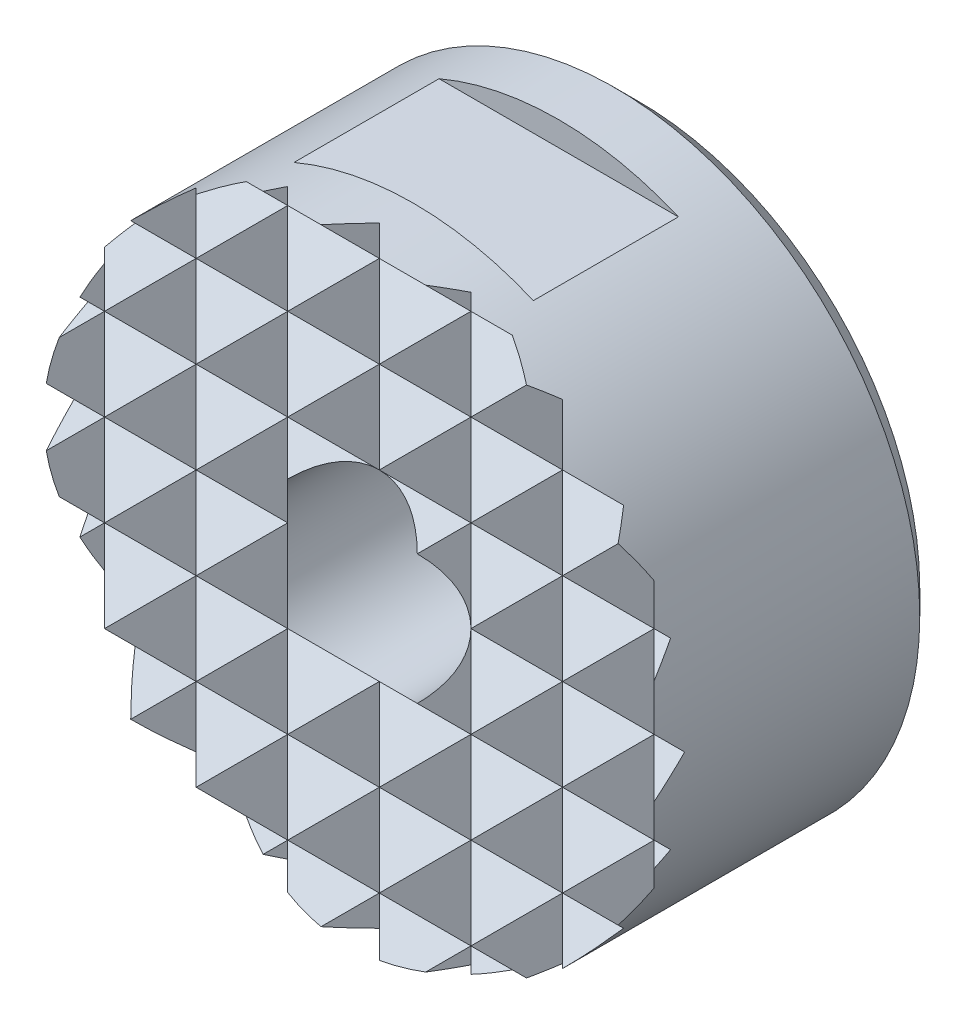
ISO-10303-21;
HEADER;
FILE_DESCRIPTION(('STEP AP214'),'2;1');
FILE_NAME('part.step','',(''),(''),'','','');
FILE_SCHEMA(('AUTOMOTIVE_DESIGN { 1 0 10303 214 1 1 1 1 }'));
ENDSEC;
DATA;
#1=APPLICATION_CONTEXT('core data for automotive mechanical design processes');
#2=APPLICATION_PROTOCOL_DEFINITION('international standard','automotive_design',2000,#1);
#3=PRODUCT_CONTEXT('',#1,'mechanical');
#4=PRODUCT('Part','Part','',(#3));
#5=PRODUCT_RELATED_PRODUCT_CATEGORY('part','',(#4));
#6=PRODUCT_DEFINITION_FORMATION('','',#4);
#7=PRODUCT_DEFINITION_CONTEXT('part definition',#1,'design');
#8=PRODUCT_DEFINITION('design','',#6,#7);
#9=PRODUCT_DEFINITION_SHAPE('','',#8);
#10=(LENGTH_UNIT() NAMED_UNIT(*) SI_UNIT(.MILLI.,.METRE.));
#11=(NAMED_UNIT(*) PLANE_ANGLE_UNIT() SI_UNIT($,.RADIAN.));
#12=(NAMED_UNIT(*) SI_UNIT($,.STERADIAN.) SOLID_ANGLE_UNIT());
#13=UNCERTAINTY_MEASURE_WITH_UNIT(LENGTH_MEASURE(1.E-05),#10,'distance_accuracy_value','');
#14=(GEOMETRIC_REPRESENTATION_CONTEXT(3) GLOBAL_UNCERTAINTY_ASSIGNED_CONTEXT((#13)) GLOBAL_UNIT_ASSIGNED_CONTEXT((#10,
#11,#12)) REPRESENTATION_CONTEXT('',''));
#15=CARTESIAN_POINT('',(0.,0.,0.));
#16=DIRECTION('',(0.,0.,1.));
#17=DIRECTION('',(1.,0.,0.));
#18=AXIS2_PLACEMENT_3D('',#15,#16,#17);
#19=CARTESIAN_POINT('',(4.5,-15.,10.));
#20=DIRECTION('',(-0.707106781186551,0.,-0.707106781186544));
#21=DIRECTION('',(-0.707106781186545,0.,0.707106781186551));
#22=AXIS2_PLACEMENT_3D('',#19,#20,#21);
#23=PLANE('',#22);
#24=DIRECTION('',(-0.577350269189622,-0.577350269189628,0.577350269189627));
#25=VECTOR('',#24,1.);
#26=CARTESIAN_POINT('',(2.,-10.,12.5));
#27=LINE('',#26,#25);
#28=CARTESIAN_POINT('',(6.,-6.,8.5));
#29=VERTEX_POINT('',#28);
#30=CARTESIAN_POINT('',(4.5,-7.5,10.));
#31=VERTEX_POINT('',#30);
#32=EDGE_CURVE('E725',#29,#31,#27,.T.);
#33=ORIENTED_EDGE('',*,*,#32,.T.);
#34=DIRECTION('',(0.577350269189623,-0.577350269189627,-0.577350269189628));
#35=VECTOR('',#34,1.);
#36=CARTESIAN_POINT('',(7.,-10.,7.5));
#37=LINE('',#36,#35);
#38=CARTESIAN_POINT('',(5.41013748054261,-8.41013748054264,9.08986251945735));
#39=VERTEX_POINT('',#38);
#40=EDGE_CURVE('E704',#31,#39,#37,.T.);
#41=ORIENTED_EDGE('',*,*,#40,.T.);
#42=CARTESIAN_POINT('',(0.,0.,14.5));
#43=DIRECTION('',(-0.707106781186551,0.,-0.707106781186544));
#44=DIRECTION('',(0.707106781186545,0.,-0.707106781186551));
#45=AXIS2_PLACEMENT_3D('',#42,#43,#44);
#46=ELLIPSE('',#45,14.142135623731,10.);
#47=CARTESIAN_POINT('',(6.,-8.,8.5));
#48=VERTEX_POINT('',#47);
#49=EDGE_CURVE('E607',#48,#39,#46,.T.);
#50=ORIENTED_EDGE('',*,*,#49,.F.);
#51=DIRECTION('',(0.,1.,0.));
#52=VECTOR('',#51,1.);
#53=CARTESIAN_POINT('',(6.,-15.,8.5));
#54=LINE('',#53,#52);
#55=EDGE_CURVE('E508',#48,#29,#54,.T.);
#56=ORIENTED_EDGE('',*,*,#55,.T.);
#57=EDGE_LOOP('',(#33,#41,#50,#56));
#58=FACE_BOUND('',#57,.T.);
#59=ADVANCED_FACE('F15',(#58),#23,.F.);
#60=CARTESIAN_POINT('',(5.41013748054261,8.41013748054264,9.08986251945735));
#61=VERTEX_POINT('',#60);
#62=CARTESIAN_POINT('',(6.,8.,8.5));
#63=VERTEX_POINT('',#62);
#64=EDGE_CURVE('E604',#61,#63,#46,.T.);
#65=ORIENTED_EDGE('',*,*,#64,.F.);
#66=DIRECTION('',(-0.577350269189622,-0.577350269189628,0.577350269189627));
#67=VECTOR('',#66,1.);
#68=CARTESIAN_POINT('',(-3.,0.,17.5));
#69=LINE('',#68,#67);
#70=CARTESIAN_POINT('',(4.5,7.5,10.));
#71=VERTEX_POINT('',#70);
#72=EDGE_CURVE('E1107',#61,#71,#69,.T.);
#73=ORIENTED_EDGE('',*,*,#72,.T.);
#74=DIRECTION('',(0.577350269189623,-0.577350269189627,-0.577350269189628));
#75=VECTOR('',#74,1.);
#76=CARTESIAN_POINT('',(12.,0.,2.49999999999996));
#77=LINE('',#76,#75);
#78=CARTESIAN_POINT('',(6.,6.,8.5));
#79=VERTEX_POINT('',#78);
#80=EDGE_CURVE('E1080',#71,#79,#77,.T.);
#81=ORIENTED_EDGE('',*,*,#80,.T.);
#82=EDGE_CURVE('E513',#79,#63,#54,.T.);
#83=ORIENTED_EDGE('',*,*,#82,.T.);
#84=EDGE_LOOP('',(#65,#73,#81,#83));
#85=FACE_BOUND('',#84,.T.);
#86=ADVANCED_FACE('F1456',(#85),#23,.F.);
#87=CARTESIAN_POINT('',(6.,-15.,8.5));
#88=DIRECTION('',(0.707106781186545,0.,-0.707106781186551));
#89=DIRECTION('',(-0.707106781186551,0.,-0.707106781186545));
#90=AXIS2_PLACEMENT_3D('',#87,#88,#89);
#91=PLANE('',#90);
#92=CARTESIAN_POINT('',(0.,0.,2.50000000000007));
#93=DIRECTION('',(0.707106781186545,0.,-0.707106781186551));
#94=DIRECTION('',(-0.707106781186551,0.,-0.707106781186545));
#95=AXIS2_PLACEMENT_3D('',#92,#93,#94);
#96=ELLIPSE('',#95,14.1421356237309,10.);
#97=CARTESIAN_POINT('',(7.07106781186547,-7.07106781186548,9.57106781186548));
#98=VERTEX_POINT('',#97);
#99=EDGE_CURVE('E611',#98,#48,#96,.T.);
#100=ORIENTED_EDGE('',*,*,#99,.F.);
#101=DIRECTION('',(-0.577350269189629,0.577350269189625,-0.577350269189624));
#102=VECTOR('',#101,1.);
#103=CARTESIAN_POINT('',(9.,-9.,11.5));
#104=LINE('',#103,#102);
#105=EDGE_CURVE('E727',#98,#29,#104,.T.);
#106=ORIENTED_EDGE('',*,*,#105,.T.);
#107=ORIENTED_EDGE('',*,*,#55,.F.);
#108=EDGE_LOOP('',(#100,#106,#107));
#109=FACE_BOUND('',#108,.T.);
#110=ADVANCED_FACE('F1401',(#109),#91,.F.);
#111=ORIENTED_EDGE('',*,*,#82,.F.);
#112=DIRECTION('',(0.57735026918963,0.577350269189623,0.577350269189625));
#113=VECTOR('',#112,1.);
#114=CARTESIAN_POINT('',(-1.00000000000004,-0.999999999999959,1.50000000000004));
#115=LINE('',#114,#113);
#116=CARTESIAN_POINT('',(7.07106781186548,7.07106781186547,9.57106781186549));
#117=VERTEX_POINT('',#116);
#118=EDGE_CURVE('E1083',#79,#117,#115,.T.);
#119=ORIENTED_EDGE('',*,*,#118,.T.);
#120=EDGE_CURVE('E606',#63,#117,#96,.T.);
#121=ORIENTED_EDGE('',*,*,#120,.F.);
#122=EDGE_LOOP('',(#111,#119,#121));
#123=FACE_BOUND('',#122,.T.);
#124=ADVANCED_FACE('F1453',(#123),#91,.F.);
#125=CARTESIAN_POINT('',(7.5,-15.,10.));
#126=DIRECTION('',(-0.70710678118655,0.,-0.707106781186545));
#127=DIRECTION('',(-0.707106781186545,0.,0.70710678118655));
#128=AXIS2_PLACEMENT_3D('',#125,#126,#127);
#129=PLANE('',#128);
#130=DIRECTION('',(-0.577350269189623,-0.577350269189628,0.577350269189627));
#131=VECTOR('',#130,1.);
#132=CARTESIAN_POINT('',(4.,-8.,13.5));
#133=LINE('',#132,#131);
#134=CARTESIAN_POINT('',(9.,-3.,8.5));
#135=VERTEX_POINT('',#134);
#136=CARTESIAN_POINT('',(7.5,-4.5,10.));
#137=VERTEX_POINT('',#136);
#138=EDGE_CURVE('E803',#135,#137,#133,.T.);
#139=ORIENTED_EDGE('',*,*,#138,.T.);
#140=DIRECTION('',(0.577350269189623,-0.577350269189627,-0.577350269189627));
#141=VECTOR('',#140,1.);
#142=CARTESIAN_POINT('',(11.,-8.,6.5));
#143=LINE('',#142,#141);
#144=CARTESIAN_POINT('',(8.41013748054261,-5.41013748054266,9.08986251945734));
#145=VERTEX_POINT('',#144);
#146=EDGE_CURVE('E764',#137,#145,#143,.T.);
#147=ORIENTED_EDGE('',*,*,#146,.T.);
#148=CARTESIAN_POINT('',(0.,0.,17.5));
#149=DIRECTION('',(-0.70710678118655,0.,-0.707106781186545));
#150=DIRECTION('',(0.707106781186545,0.,-0.70710678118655));
#151=AXIS2_PLACEMENT_3D('',#148,#149,#150);
#152=ELLIPSE('',#151,14.142135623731,10.);
#153=CARTESIAN_POINT('',(9.,-4.35889894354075,8.5));
#154=VERTEX_POINT('',#153);
#155=EDGE_CURVE('E614',#154,#145,#152,.T.);
#156=ORIENTED_EDGE('',*,*,#155,.F.);
#157=DIRECTION('',(0.,1.,0.));
#158=VECTOR('',#157,1.);
#159=CARTESIAN_POINT('',(9.,-15.,8.5));
#160=LINE('',#159,#158);
#161=EDGE_CURVE('E514',#154,#135,#160,.T.);
#162=ORIENTED_EDGE('',*,*,#161,.T.);
#163=EDGE_LOOP('',(#139,#147,#156,#162));
#164=FACE_BOUND('',#163,.T.);
#165=ADVANCED_FACE('F1415',(#164),#129,.F.);
#166=DIRECTION('',(-0.577350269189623,-0.577350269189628,0.577350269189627));
#167=VECTOR('',#166,1.);
#168=CARTESIAN_POINT('',(3.,-6.,14.5));
#169=LINE('',#168,#167);
#170=CARTESIAN_POINT('',(9.,0.,8.5));
#171=VERTEX_POINT('',#170);
#172=CARTESIAN_POINT('',(7.5,-1.50000000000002,10.));
#173=VERTEX_POINT('',#172);
#174=EDGE_CURVE('E873',#171,#173,#169,.T.);
#175=ORIENTED_EDGE('',*,*,#174,.T.);
#176=DIRECTION('',(0.577350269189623,-0.577350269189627,-0.577350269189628));
#177=VECTOR('',#176,1.);
#178=CARTESIAN_POINT('',(12.,-6.,5.5));
#179=LINE('',#178,#177);
#180=EDGE_CURVE('E842',#173,#135,#179,.T.);
#181=ORIENTED_EDGE('',*,*,#180,.T.);
#182=EDGE_CURVE('E517',#135,#171,#160,.T.);
#183=ORIENTED_EDGE('',*,*,#182,.T.);
#184=EDGE_LOOP('',(#175,#181,#183));
#185=FACE_BOUND('',#184,.T.);
#186=ADVANCED_FACE('F1423',(#185),#129,.F.);
#187=DIRECTION('',(-0.577350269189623,-0.577350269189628,0.577350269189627));
#188=VECTOR('',#187,1.);
#189=CARTESIAN_POINT('',(2.,-4.,15.5));
#190=LINE('',#189,#188);
#191=CARTESIAN_POINT('',(9.,3.,8.5));
#192=VERTEX_POINT('',#191);
#193=CARTESIAN_POINT('',(7.5,1.49999999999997,10.));
#194=VERTEX_POINT('',#193);
#195=EDGE_CURVE('E486',#192,#194,#190,.T.);
#196=ORIENTED_EDGE('',*,*,#195,.T.);
#197=DIRECTION('',(0.577350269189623,-0.577350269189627,-0.577350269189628));
#198=VECTOR('',#197,1.);
#199=CARTESIAN_POINT('',(13.,-4.,4.5));
#200=LINE('',#199,#198);
#201=EDGE_CURVE('E902',#194,#171,#200,.T.);
#202=ORIENTED_EDGE('',*,*,#201,.T.);
#203=EDGE_CURVE('E1431',#171,#192,#160,.T.);
#204=ORIENTED_EDGE('',*,*,#203,.T.);
#205=EDGE_LOOP('',(#196,#202,#204));
#206=FACE_BOUND('',#205,.T.);
#207=ADVANCED_FACE('F1680',(#206),#129,.F.);
#208=CARTESIAN_POINT('',(9.,-15.,8.5));
#209=DIRECTION('',(0.707106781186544,0.,-0.707106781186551));
#210=DIRECTION('',(-0.707106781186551,0.,-0.707106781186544));
#211=AXIS2_PLACEMENT_3D('',#208,#209,#210);
#212=PLANE('',#211);
#213=ORIENTED_EDGE('',*,*,#203,.F.);
#214=DIRECTION('',(0.57735026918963,0.577350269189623,0.577350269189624));
#215=VECTOR('',#214,1.);
#216=CARTESIAN_POINT('',(3.99999999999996,-5.,3.5));
#217=LINE('',#216,#215);
#218=CARTESIAN_POINT('',(9.95435605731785,0.954356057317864,9.45435605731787));
#219=VERTEX_POINT('',#218);
#220=EDGE_CURVE('E905',#171,#219,#217,.T.);
#221=ORIENTED_EDGE('',*,*,#220,.T.);
#222=CARTESIAN_POINT('',(0.,0.,-0.499999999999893));
#223=DIRECTION('',(0.707106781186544,0.,-0.707106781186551));
#224=DIRECTION('',(-0.707106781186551,0.,-0.707106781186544));
#225=AXIS2_PLACEMENT_3D('',#222,#223,#224);
#226=ELLIPSE('',#225,14.1421356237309,10.);
#227=CARTESIAN_POINT('',(9.74165738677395,2.25834261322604,9.24165738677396));
#228=VERTEX_POINT('',#227);
#229=EDGE_CURVE('E618',#228,#219,#226,.T.);
#230=ORIENTED_EDGE('',*,*,#229,.F.);
#231=DIRECTION('',(-0.577350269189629,0.577350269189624,-0.577350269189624));
#232=VECTOR('',#231,1.);
#233=CARTESIAN_POINT('',(15.,-2.99999999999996,14.5));
#234=LINE('',#233,#232);
#235=EDGE_CURVE('E478',#228,#192,#234,.T.);
#236=ORIENTED_EDGE('',*,*,#235,.T.);
#237=EDGE_LOOP('',(#213,#221,#230,#236));
#238=FACE_BOUND('',#237,.T.);
#239=ADVANCED_FACE('F1672',(#238),#212,.F.);
#240=CARTESIAN_POINT('',(9.95435605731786,-0.954356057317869,9.45435605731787));
#241=VERTEX_POINT('',#240);
#242=CARTESIAN_POINT('',(9.74165738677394,-2.25834261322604,9.24165738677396));
#243=VERTEX_POINT('',#242);
#244=EDGE_CURVE('E3029',#241,#243,#226,.T.);
#245=ORIENTED_EDGE('',*,*,#244,.F.);
#246=DIRECTION('',(-0.577350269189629,0.577350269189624,-0.577350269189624));
#247=VECTOR('',#246,1.);
#248=CARTESIAN_POINT('',(14.,-5.,13.5));
#249=LINE('',#248,#247);
#250=EDGE_CURVE('E875',#241,#171,#249,.T.);
#251=ORIENTED_EDGE('',*,*,#250,.T.);
#252=ORIENTED_EDGE('',*,*,#182,.F.);
#253=DIRECTION('',(0.57735026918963,0.577350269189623,0.577350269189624));
#254=VECTOR('',#253,1.);
#255=CARTESIAN_POINT('',(5.,-7.,4.5));
#256=LINE('',#255,#254);
#257=EDGE_CURVE('E845',#135,#243,#256,.T.);
#258=ORIENTED_EDGE('',*,*,#257,.T.);
#259=EDGE_LOOP('',(#245,#251,#252,#258));
#260=FACE_BOUND('',#259,.T.);
#261=ADVANCED_FACE('F1429',(#260),#212,.F.);
#262=CARTESIAN_POINT('',(9.40312423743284,-3.40312423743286,8.90312423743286));
#263=VERTEX_POINT('',#262);
#264=EDGE_CURVE('E613',#263,#154,#226,.T.);
#265=ORIENTED_EDGE('',*,*,#264,.F.);
#266=DIRECTION('',(-0.577350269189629,0.577350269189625,-0.577350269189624));
#267=VECTOR('',#266,1.);
#268=CARTESIAN_POINT('',(13.,-7.,12.5));
#269=LINE('',#268,#267);
#270=EDGE_CURVE('E805',#263,#135,#269,.T.);
#271=ORIENTED_EDGE('',*,*,#270,.T.);
#272=ORIENTED_EDGE('',*,*,#161,.F.);
#273=EDGE_LOOP('',(#265,#271,#272));
#274=FACE_BOUND('',#273,.T.);
#275=ADVANCED_FACE('F1418',(#274),#212,.F.);
#276=CARTESIAN_POINT('',(-10.5,-15.,10.));
#277=DIRECTION('',(-0.70710678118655,0.,-0.707106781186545));
#278=DIRECTION('',(-0.707106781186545,0.,0.70710678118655));
#279=AXIS2_PLACEMENT_3D('',#276,#277,#278);
#280=PLANE('',#279);
#281=CARTESIAN_POINT('',(0.,0.,-0.499999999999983));
#282=DIRECTION('',(-0.70710678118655,0.,-0.707106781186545));
#283=DIRECTION('',(0.707106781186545,0.,-0.70710678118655));
#284=AXIS2_PLACEMENT_3D('',#281,#282,#283);
#285=ELLIPSE('',#284,14.142135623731,10.);
#286=CARTESIAN_POINT('',(-9.95435605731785,0.954356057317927,9.45435605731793));
#287=VERTEX_POINT('',#286);
#288=CARTESIAN_POINT('',(-9.74165738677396,2.25834261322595,9.24165738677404));
#289=VERTEX_POINT('',#288);
#290=EDGE_CURVE('E467',#287,#289,#285,.T.);
#291=ORIENTED_EDGE('',*,*,#290,.F.);
#292=DIRECTION('',(0.577350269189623,-0.577350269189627,-0.577350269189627));
#293=VECTOR('',#292,1.);
#294=CARTESIAN_POINT('',(-5.,-4.,4.5));
#295=LINE('',#294,#293);
#296=CARTESIAN_POINT('',(-9.,0.,8.5));
#297=VERTEX_POINT('',#296);
#298=EDGE_CURVE('E887',#287,#297,#295,.T.);
#299=ORIENTED_EDGE('',*,*,#298,.T.);
#300=DIRECTION('',(0.,1.,0.));
#301=VECTOR('',#300,1.);
#302=CARTESIAN_POINT('',(-9.,-15.,8.5));
#303=LINE('',#302,#301);
#304=CARTESIAN_POINT('',(-9.,3.,8.5));
#305=VERTEX_POINT('',#304);
#306=EDGE_CURVE('E924',#297,#305,#303,.T.);
#307=ORIENTED_EDGE('',*,*,#306,.T.);
#308=DIRECTION('',(-0.577350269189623,-0.577350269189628,0.577350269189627));
#309=VECTOR('',#308,1.);
#310=CARTESIAN_POINT('',(-16.,-4.00000000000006,15.5));
#311=LINE('',#310,#309);
#312=EDGE_CURVE('E456',#305,#289,#311,.T.);
#313=ORIENTED_EDGE('',*,*,#312,.T.);
#314=EDGE_LOOP('',(#291,#299,#307,#313));
#315=FACE_BOUND('',#314,.T.);
#316=ADVANCED_FACE('F922',(#315),#280,.F.);
#317=CARTESIAN_POINT('',(-9.,-3.,8.5));
#318=VERTEX_POINT('',#317);
#319=EDGE_CURVE('E522',#318,#297,#303,.T.);
#320=ORIENTED_EDGE('',*,*,#319,.T.);
#321=DIRECTION('',(-0.577350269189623,-0.577350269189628,0.577350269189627));
#322=VECTOR('',#321,1.);
#323=CARTESIAN_POINT('',(-15.,-6.,14.5));
#324=LINE('',#323,#322);
#325=CARTESIAN_POINT('',(-9.95435605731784,-0.954356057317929,9.45435605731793));
#326=VERTEX_POINT('',#325);
#327=EDGE_CURVE('E857',#297,#326,#324,.T.);
#328=ORIENTED_EDGE('',*,*,#327,.T.);
#329=CARTESIAN_POINT('',(-9.74165738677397,-2.25834261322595,9.24165738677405));
#330=VERTEX_POINT('',#329);
#331=EDGE_CURVE('E603',#330,#326,#285,.T.);
#332=ORIENTED_EDGE('',*,*,#331,.F.);
#333=DIRECTION('',(0.577350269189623,-0.577350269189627,-0.577350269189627));
#334=VECTOR('',#333,1.);
#335=CARTESIAN_POINT('',(-6.,-6.,5.5));
#336=LINE('',#335,#334);
#337=EDGE_CURVE('E820',#330,#318,#336,.T.);
#338=ORIENTED_EDGE('',*,*,#337,.T.);
#339=EDGE_LOOP('',(#320,#328,#332,#338));
#340=FACE_BOUND('',#339,.T.);
#341=ADVANCED_FACE('F944',(#340),#280,.F.);
#342=CARTESIAN_POINT('',(-9.,-4.35889894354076,8.5));
#343=VERTEX_POINT('',#342);
#344=EDGE_CURVE('E519',#343,#318,#303,.T.);
#345=ORIENTED_EDGE('',*,*,#344,.T.);
#346=DIRECTION('',(-0.577350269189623,-0.577350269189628,0.577350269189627));
#347=VECTOR('',#346,1.);
#348=CARTESIAN_POINT('',(-14.,-8.,13.5));
#349=LINE('',#348,#347);
#350=CARTESIAN_POINT('',(-9.40312423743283,-3.40312423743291,8.90312423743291));
#351=VERTEX_POINT('',#350);
#352=EDGE_CURVE('E779',#318,#351,#349,.T.);
#353=ORIENTED_EDGE('',*,*,#352,.T.);
#354=EDGE_CURVE('E600',#343,#351,#285,.T.);
#355=ORIENTED_EDGE('',*,*,#354,.F.);
#356=EDGE_LOOP('',(#345,#353,#355));
#357=FACE_BOUND('',#356,.T.);
#358=ADVANCED_FACE('F1664',(#357),#280,.F.);
#359=CARTESIAN_POINT('',(-9.,-15.,8.5));
#360=DIRECTION('',(0.707106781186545,0.,-0.70710678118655));
#361=DIRECTION('',(-0.70710678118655,0.,-0.707106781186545));
#362=AXIS2_PLACEMENT_3D('',#359,#360,#361);
#363=PLANE('',#362);
#364=CARTESIAN_POINT('',(0.,0.,17.5));
#365=DIRECTION('',(0.707106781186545,0.,-0.70710678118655));
#366=DIRECTION('',(-0.70710678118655,0.,-0.707106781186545));
#367=AXIS2_PLACEMENT_3D('',#364,#365,#366);
#368=ELLIPSE('',#367,14.1421356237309,10.);
#369=CARTESIAN_POINT('',(-8.41013748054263,-5.41013748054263,9.08986251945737));
#370=VERTEX_POINT('',#369);
#371=EDGE_CURVE('E599',#370,#343,#368,.T.);
#372=ORIENTED_EDGE('',*,*,#371,.F.);
#373=DIRECTION('',(0.577350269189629,0.577350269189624,0.577350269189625));
#374=VECTOR('',#373,1.);
#375=CARTESIAN_POINT('',(-12.,-9.,5.5));
#376=LINE('',#375,#374);
#377=CARTESIAN_POINT('',(-7.49999999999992,-4.5,10.));
#378=VERTEX_POINT('',#377);
#379=EDGE_CURVE('E739',#370,#378,#376,.T.);
#380=ORIENTED_EDGE('',*,*,#379,.T.);
#381=DIRECTION('',(-0.577350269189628,0.577350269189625,-0.577350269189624));
#382=VECTOR('',#381,1.);
#383=CARTESIAN_POINT('',(-5.,-7.,12.5));
#384=LINE('',#383,#382);
#385=EDGE_CURVE('E776',#378,#318,#384,.T.);
#386=ORIENTED_EDGE('',*,*,#385,.T.);
#387=ORIENTED_EDGE('',*,*,#344,.F.);
#388=EDGE_LOOP('',(#372,#380,#386,#387));
#389=FACE_BOUND('',#388,.T.);
#390=ADVANCED_FACE('F1655',(#389),#363,.F.);
#391=ORIENTED_EDGE('',*,*,#319,.F.);
#392=DIRECTION('',(0.577350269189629,0.577350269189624,0.577350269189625));
#393=VECTOR('',#392,1.);
#394=CARTESIAN_POINT('',(-13.,-7.,4.5));
#395=LINE('',#394,#393);
#396=CARTESIAN_POINT('',(-7.49999999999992,-1.5,10.));
#397=VERTEX_POINT('',#396);
#398=EDGE_CURVE('E817',#318,#397,#395,.T.);
#399=ORIENTED_EDGE('',*,*,#398,.T.);
#400=DIRECTION('',(-0.577350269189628,0.577350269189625,-0.577350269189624));
#401=VECTOR('',#400,1.);
#402=CARTESIAN_POINT('',(-4.,-5.,13.5));
#403=LINE('',#402,#401);
#404=EDGE_CURVE('E854',#397,#297,#403,.T.);
#405=ORIENTED_EDGE('',*,*,#404,.T.);
#406=EDGE_LOOP('',(#391,#399,#405));
#407=FACE_BOUND('',#406,.T.);
#408=ADVANCED_FACE('F1856',(#407),#363,.F.);
#409=ORIENTED_EDGE('',*,*,#306,.F.);
#410=DIRECTION('',(0.577350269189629,0.577350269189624,0.577350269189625));
#411=VECTOR('',#410,1.);
#412=CARTESIAN_POINT('',(-14.,-4.99999999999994,3.50000000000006));
#413=LINE('',#412,#411);
#414=CARTESIAN_POINT('',(-7.5,1.5,10.));
#415=VERTEX_POINT('',#414);
#416=EDGE_CURVE('E884',#297,#415,#413,.T.);
#417=ORIENTED_EDGE('',*,*,#416,.T.);
#418=DIRECTION('',(-0.577350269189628,0.577350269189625,-0.577350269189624));
#419=VECTOR('',#418,1.);
#420=CARTESIAN_POINT('',(-2.99999999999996,-3.,14.5));
#421=LINE('',#420,#419);
#422=EDGE_CURVE('E917',#415,#305,#421,.T.);
#423=ORIENTED_EDGE('',*,*,#422,.T.);
#424=EDGE_LOOP('',(#409,#417,#423));
#425=FACE_BOUND('',#424,.T.);
#426=ADVANCED_FACE('F1656',(#425),#363,.F.);
#427=CARTESIAN_POINT('',(-7.5,-15.,10.));
#428=DIRECTION('',(-0.70710678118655,0.,-0.707106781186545));
#429=DIRECTION('',(-0.707106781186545,0.,0.70710678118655));
#430=AXIS2_PLACEMENT_3D('',#427,#428,#429);
#431=PLANE('',#430);
#432=DIRECTION('',(0.,1.,0.));
#433=VECTOR('',#432,1.);
#434=CARTESIAN_POINT('',(-6.,-15.,8.5));
#435=LINE('',#434,#433);
#436=CARTESIAN_POINT('',(-6.,-8.,8.5));
#437=VERTEX_POINT('',#436);
#438=CARTESIAN_POINT('',(-6.,-6.,8.5));
#439=VERTEX_POINT('',#438);
#440=EDGE_CURVE('E524',#437,#439,#435,.T.);
#441=ORIENTED_EDGE('',*,*,#440,.T.);
#442=DIRECTION('',(-0.577350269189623,-0.577350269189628,0.577350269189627));
#443=VECTOR('',#442,1.);
#444=CARTESIAN_POINT('',(-10.,-10.,12.5));
#445=LINE('',#444,#443);
#446=CARTESIAN_POINT('',(-7.07106781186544,-7.07106781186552,9.57106781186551));
#447=VERTEX_POINT('',#446);
#448=EDGE_CURVE('E677',#439,#447,#445,.T.);
#449=ORIENTED_EDGE('',*,*,#448,.T.);
#450=CARTESIAN_POINT('',(0.,0.,2.5));
#451=DIRECTION('',(-0.70710678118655,0.,-0.707106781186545));
#452=DIRECTION('',(0.707106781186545,0.,-0.70710678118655));
#453=AXIS2_PLACEMENT_3D('',#450,#451,#452);
#454=ELLIPSE('',#453,14.142135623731,10.);
#455=EDGE_CURVE('E595',#437,#447,#454,.T.);
#456=ORIENTED_EDGE('',*,*,#455,.F.);
#457=EDGE_LOOP('',(#441,#449,#456));
#458=FACE_BOUND('',#457,.T.);
#459=ADVANCED_FACE('F1836',(#458),#431,.F.);
#460=CARTESIAN_POINT('',(-7.07106781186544,7.07106781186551,9.57106781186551));
#461=VERTEX_POINT('',#460);
#462=CARTESIAN_POINT('',(-6.,8.,8.5));
#463=VERTEX_POINT('',#462);
#464=EDGE_CURVE('E591',#461,#463,#454,.T.);
#465=ORIENTED_EDGE('',*,*,#464,.F.);
#466=DIRECTION('',(0.577350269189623,-0.577350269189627,-0.577350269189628));
#467=VECTOR('',#466,1.);
#468=CARTESIAN_POINT('',(0.,0.,2.5));
#469=LINE('',#468,#467);
#470=CARTESIAN_POINT('',(-6.,6.,8.5));
#471=VERTEX_POINT('',#470);
#472=EDGE_CURVE('E1062',#461,#471,#469,.T.);
#473=ORIENTED_EDGE('',*,*,#472,.T.);
#474=EDGE_CURVE('E527',#471,#463,#435,.T.);
#475=ORIENTED_EDGE('',*,*,#474,.T.);
#476=EDGE_LOOP('',(#465,#473,#475));
#477=FACE_BOUND('',#476,.T.);
#478=ADVANCED_FACE('F1827',(#477),#431,.F.);
#479=CARTESIAN_POINT('',(-6.,-15.,8.5));
#480=DIRECTION('',(0.707106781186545,0.,-0.70710678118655));
#481=DIRECTION('',(-0.70710678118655,0.,-0.707106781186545));
#482=AXIS2_PLACEMENT_3D('',#479,#480,#481);
#483=PLANE('',#482);
#484=CARTESIAN_POINT('',(0.,0.,14.5));
#485=DIRECTION('',(0.707106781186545,0.,-0.70710678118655));
#486=DIRECTION('',(-0.70710678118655,0.,-0.707106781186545));
#487=AXIS2_PLACEMENT_3D('',#484,#485,#486);
#488=ELLIPSE('',#487,14.1421356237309,10.);
#489=CARTESIAN_POINT('',(-5.41013748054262,-8.41013748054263,9.08986251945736));
#490=VERTEX_POINT('',#489);
#491=EDGE_CURVE('E592',#490,#437,#488,.T.);
#492=ORIENTED_EDGE('',*,*,#491,.F.);
#493=DIRECTION('',(0.577350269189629,0.577350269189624,0.577350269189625));
#494=VECTOR('',#493,1.);
#495=CARTESIAN_POINT('',(-8.,-11.,6.5));
#496=LINE('',#495,#494);
#497=CARTESIAN_POINT('',(-4.49999999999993,-7.5,10.));
#498=VERTEX_POINT('',#497);
#499=EDGE_CURVE('E662',#490,#498,#496,.T.);
#500=ORIENTED_EDGE('',*,*,#499,.T.);
#501=DIRECTION('',(-0.577350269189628,0.577350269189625,-0.577350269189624));
#502=VECTOR('',#501,1.);
#503=CARTESIAN_POINT('',(-2.99999999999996,-9.,11.5));
#504=LINE('',#503,#502);
#505=EDGE_CURVE('E669',#498,#439,#504,.T.);
#506=ORIENTED_EDGE('',*,*,#505,.T.);
#507=ORIENTED_EDGE('',*,*,#440,.F.);
#508=EDGE_LOOP('',(#492,#500,#506,#507));
#509=FACE_BOUND('',#508,.T.);
#510=ADVANCED_FACE('F681',(#509),#483,.F.);
#511=DIRECTION('',(0.577350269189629,0.577350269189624,0.577350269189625));
#512=VECTOR('',#511,1.);
#513=CARTESIAN_POINT('',(-13.,-0.999999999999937,1.50000000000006));
#514=LINE('',#513,#512);
#515=CARTESIAN_POINT('',(-4.49999999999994,7.5,10.));
#516=VERTEX_POINT('',#515);
#517=EDGE_CURVE('E1059',#471,#516,#514,.T.);
#518=ORIENTED_EDGE('',*,*,#517,.T.);
#519=DIRECTION('',(-0.577350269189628,0.577350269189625,-0.577350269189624));
#520=VECTOR('',#519,1.);
#521=CARTESIAN_POINT('',(2.00000000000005,1.,16.5));
#522=LINE('',#521,#520);
#523=CARTESIAN_POINT('',(-5.41013748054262,8.41013748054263,9.08986251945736));
#524=VERTEX_POINT('',#523);
#525=EDGE_CURVE('E1089',#516,#524,#522,.T.);
#526=ORIENTED_EDGE('',*,*,#525,.T.);
#527=EDGE_CURVE('E588',#463,#524,#488,.T.);
#528=ORIENTED_EDGE('',*,*,#527,.F.);
#529=ORIENTED_EDGE('',*,*,#474,.F.);
#530=EDGE_LOOP('',(#518,#526,#528,#529));
#531=FACE_BOUND('',#530,.T.);
#532=ADVANCED_FACE('F1810',(#531),#483,.F.);
#533=CARTESIAN_POINT('',(-2.99999999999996,-15.,8.5));
#534=DIRECTION('',(0.707106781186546,0.,-0.707106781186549));
#535=DIRECTION('',(-0.707106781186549,0.,-0.707106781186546));
#536=AXIS2_PLACEMENT_3D('',#533,#534,#535);
#537=PLANE('',#536);
#538=DIRECTION('',(0.,1.,0.));
#539=VECTOR('',#538,1.);
#540=CARTESIAN_POINT('',(-2.99999999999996,-15.,8.5));
#541=LINE('',#540,#539);
#542=CARTESIAN_POINT('',(-2.99999999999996,9.,8.5));
#543=VERTEX_POINT('',#542);
#544=CARTESIAN_POINT('',(-2.99999999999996,9.53939201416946,8.5));
#545=VERTEX_POINT('',#544);
#546=EDGE_CURVE('E477',#543,#545,#541,.T.);
#547=ORIENTED_EDGE('',*,*,#546,.F.);
#548=DIRECTION('',(0.577350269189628,0.577350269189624,0.577350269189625));
#549=VECTOR('',#548,1.);
#550=CARTESIAN_POINT('',(-11.,1.00000000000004,0.500000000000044));
#551=LINE('',#550,#549);
#552=CARTESIAN_POINT('',(-2.25834261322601,9.74165738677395,9.24165738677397));
#553=VERTEX_POINT('',#552);
#554=EDGE_CURVE('E1109',#543,#553,#551,.T.);
#555=ORIENTED_EDGE('',*,*,#554,.T.);
#556=CARTESIAN_POINT('',(0.,0.,11.5));
#557=DIRECTION('',(0.707106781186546,0.,-0.707106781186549));
#558=DIRECTION('',(-0.707106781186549,0.,-0.707106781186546));
#559=AXIS2_PLACEMENT_3D('',#556,#557,#558);
#560=ELLIPSE('',#559,14.1421356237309,10.);
#561=EDGE_CURVE('E550',#545,#553,#560,.T.);
#562=ORIENTED_EDGE('',*,*,#561,.F.);
#563=EDGE_LOOP('',(#547,#555,#562));
#564=FACE_BOUND('',#563,.T.);
#565=ADVANCED_FACE('F1209',(#564),#537,.F.);
#566=CARTESIAN_POINT('',(0.,0.,11.5));
#567=DIRECTION('',(0.707106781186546,0.,-0.707106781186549));
#568=DIRECTION('',(0.707106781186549,0.,0.707106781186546));
#569=AXIS2_PLACEMENT_3D('',#566,#567,#568);
#570=ELLIPSE('',#569,4.24264068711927,3.);
#571=CARTESIAN_POINT('',(-2.99999999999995,0.,8.5));
#572=VERTEX_POINT('',#571);
#573=CARTESIAN_POINT('',(-2.12132034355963,2.12132034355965,9.37867965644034));
#574=VERTEX_POINT('',#573);
#575=EDGE_CURVE('E584',#572,#574,#570,.T.);
#576=ORIENTED_EDGE('',*,*,#575,.T.);
#577=DIRECTION('',(-0.577350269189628,0.577350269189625,-0.577350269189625));
#578=VECTOR('',#577,1.);
#579=CARTESIAN_POINT('',(3.00000000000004,-3.,14.5));
#580=LINE('',#579,#578);
#581=CARTESIAN_POINT('',(-2.99999999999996,3.,8.5));
#582=VERTEX_POINT('',#581);
#583=EDGE_CURVE('E908',#574,#582,#580,.T.);
#584=ORIENTED_EDGE('',*,*,#583,.T.);
#585=EDGE_CURVE('E484',#572,#582,#541,.T.);
#586=ORIENTED_EDGE('',*,*,#585,.F.);
#587=EDGE_LOOP('',(#576,#584,#586));
#588=FACE_BOUND('',#587,.T.);
#589=ADVANCED_FACE('F1794',(#588),#537,.F.);
#590=CARTESIAN_POINT('',(-2.99999999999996,-3.,8.5));
#591=VERTEX_POINT('',#590);
#592=EDGE_CURVE('E530',#591,#572,#541,.T.);
#593=ORIENTED_EDGE('',*,*,#592,.F.);
#594=DIRECTION('',(0.577350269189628,0.577350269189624,0.577350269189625));
#595=VECTOR('',#594,1.);
#596=CARTESIAN_POINT('',(-7.,-7.,4.5));
#597=LINE('',#596,#595);
#598=CARTESIAN_POINT('',(-2.12132034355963,-2.12132034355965,9.37867965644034));
#599=VERTEX_POINT('',#598);
#600=EDGE_CURVE('E808',#591,#599,#597,.T.);
#601=ORIENTED_EDGE('',*,*,#600,.T.);
#602=EDGE_CURVE('E587',#599,#572,#570,.T.);
#603=ORIENTED_EDGE('',*,*,#602,.T.);
#604=EDGE_LOOP('',(#593,#601,#603));
#605=FACE_BOUND('',#604,.T.);
#606=ADVANCED_FACE('F1785',(#605),#537,.F.);
#607=CARTESIAN_POINT('',(-1.49999999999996,-15.,10.));
#608=DIRECTION('',(-0.70710678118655,0.,-0.707106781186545));
#609=DIRECTION('',(-0.707106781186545,0.,0.70710678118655));
#610=AXIS2_PLACEMENT_3D('',#607,#608,#609);
#611=PLANE('',#610);
#612=CARTESIAN_POINT('',(0.,0.,8.5));
#613=DIRECTION('',(-0.70710678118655,0.,-0.707106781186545));
#614=DIRECTION('',(0.707106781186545,0.,-0.70710678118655));
#615=AXIS2_PLACEMENT_3D('',#612,#613,#614);
#616=ELLIPSE('',#615,14.142135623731,10.);
#617=CARTESIAN_POINT('',(-0.954356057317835,9.95435605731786,9.45435605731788));
#618=VERTEX_POINT('',#617);
#619=CARTESIAN_POINT('',(0.,10.,8.5));
#620=VERTEX_POINT('',#619);
#621=EDGE_CURVE('E545',#618,#620,#616,.T.);
#622=ORIENTED_EDGE('',*,*,#621,.F.);
#623=DIRECTION('',(0.577350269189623,-0.577350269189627,-0.577350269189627));
#624=VECTOR('',#623,1.);
#625=CARTESIAN_POINT('',(7.,1.99999999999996,1.49999999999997));
#626=LINE('',#625,#624);
#627=CARTESIAN_POINT('',(0.,9.,8.5));
#628=VERTEX_POINT('',#627);
#629=EDGE_CURVE('E1117',#618,#628,#626,.T.);
#630=ORIENTED_EDGE('',*,*,#629,.T.);
#631=DIRECTION('',(0.,1.,0.));
#632=VECTOR('',#631,1.);
#633=CARTESIAN_POINT('',(0.,-15.,8.5));
#634=LINE('',#633,#632);
#635=EDGE_CURVE('E500',#628,#620,#634,.T.);
#636=ORIENTED_EDGE('',*,*,#635,.T.);
#637=EDGE_LOOP('',(#622,#630,#636));
#638=FACE_BOUND('',#637,.T.);
#639=ADVANCED_FACE('F1777',(#638),#611,.F.);
#640=CARTESIAN_POINT('',(0.,-15.,8.5));
#641=DIRECTION('',(0.707106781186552,0.,-0.707106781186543));
#642=DIRECTION('',(-0.707106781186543,0.,-0.707106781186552));
#643=AXIS2_PLACEMENT_3D('',#640,#641,#642);
#644=PLANE('',#643);
#645=ORIENTED_EDGE('',*,*,#635,.F.);
#646=DIRECTION('',(0.577350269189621,0.577350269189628,0.577350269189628));
#647=VECTOR('',#646,1.);
#648=CARTESIAN_POINT('',(-8.,0.999999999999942,0.499999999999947));
#649=LINE('',#648,#647);
#650=CARTESIAN_POINT('',(0.95435605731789,9.95435605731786,9.45435605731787));
#651=VERTEX_POINT('',#650);
#652=EDGE_CURVE('E1120',#628,#651,#649,.T.);
#653=ORIENTED_EDGE('',*,*,#652,.T.);
#654=CARTESIAN_POINT('',(0.,0.,8.5));
#655=DIRECTION('',(0.707106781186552,0.,-0.707106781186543));
#656=DIRECTION('',(-0.707106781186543,0.,-0.707106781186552));
#657=AXIS2_PLACEMENT_3D('',#654,#655,#656);
#658=ELLIPSE('',#657,14.142135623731,10.);
#659=EDGE_CURVE('E544',#620,#651,#658,.T.);
#660=ORIENTED_EDGE('',*,*,#659,.F.);
#661=EDGE_LOOP('',(#645,#653,#660));
#662=FACE_BOUND('',#661,.T.);
#663=ADVANCED_FACE('F1624',(#662),#644,.F.);
#664=CARTESIAN_POINT('',(1.5,-15.,10.));
#665=DIRECTION('',(-0.707106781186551,0.,-0.707106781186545));
#666=DIRECTION('',(-0.707106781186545,0.,0.707106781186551));
#667=AXIS2_PLACEMENT_3D('',#664,#665,#666);
#668=PLANE('',#667);
#669=CARTESIAN_POINT('',(0.,0.,11.5));
#670=DIRECTION('',(-0.707106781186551,0.,-0.707106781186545));
#671=DIRECTION('',(-0.707106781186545,0.,0.707106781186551));
#672=AXIS2_PLACEMENT_3D('',#669,#670,#671);
#673=ELLIPSE('',#672,4.24264068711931,3.);
#674=CARTESIAN_POINT('',(3.,0.,8.5));
#675=VERTEX_POINT('',#674);
#676=CARTESIAN_POINT('',(2.12132034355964,-2.12132034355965,9.37867965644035));
#677=VERTEX_POINT('',#676);
#678=EDGE_CURVE('E580',#675,#677,#673,.T.);
#679=ORIENTED_EDGE('',*,*,#678,.T.);
#680=DIRECTION('',(0.577350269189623,-0.577350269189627,-0.577350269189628));
#681=VECTOR('',#680,1.);
#682=CARTESIAN_POINT('',(6.,-6.,5.5));
#683=LINE('',#682,#681);
#684=CARTESIAN_POINT('',(3.,-3.,8.5));
#685=VERTEX_POINT('',#684);
#686=EDGE_CURVE('E829',#677,#685,#683,.T.);
#687=ORIENTED_EDGE('',*,*,#686,.T.);
#688=DIRECTION('',(0.,1.,0.));
#689=VECTOR('',#688,1.);
#690=CARTESIAN_POINT('',(3.,-15.,8.5));
#691=LINE('',#690,#689);
#692=EDGE_CURVE('E505',#685,#675,#691,.T.);
#693=ORIENTED_EDGE('',*,*,#692,.T.);
#694=EDGE_LOOP('',(#679,#687,#693));
#695=FACE_BOUND('',#694,.T.);
#696=ADVANCED_FACE('F1604',(#695),#668,.F.);
#697=CARTESIAN_POINT('',(0.,0.,11.5));
#698=DIRECTION('',(-0.707106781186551,0.,-0.707106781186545));
#699=DIRECTION('',(0.707106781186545,0.,-0.707106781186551));
#700=AXIS2_PLACEMENT_3D('',#697,#698,#699);
#701=ELLIPSE('',#700,14.142135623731,10.);
#702=CARTESIAN_POINT('',(2.25834261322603,9.74165738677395,9.24165738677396));
#703=VERTEX_POINT('',#702);
#704=CARTESIAN_POINT('',(3.,9.53939201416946,8.5));
#705=VERTEX_POINT('',#704);
#706=EDGE_CURVE('E539',#703,#705,#701,.T.);
#707=ORIENTED_EDGE('',*,*,#706,.F.);
#708=DIRECTION('',(0.577350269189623,-0.577350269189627,-0.577350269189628));
#709=VECTOR('',#708,1.);
#710=CARTESIAN_POINT('',(10.,1.99999999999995,1.49999999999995));
#711=LINE('',#710,#709);
#712=CARTESIAN_POINT('',(3.,9.,8.5));
#713=VERTEX_POINT('',#712);
#714=EDGE_CURVE('E1124',#703,#713,#711,.T.);
#715=ORIENTED_EDGE('',*,*,#714,.T.);
#716=EDGE_CURVE('E511',#713,#705,#691,.T.);
#717=ORIENTED_EDGE('',*,*,#716,.T.);
#718=EDGE_LOOP('',(#707,#715,#717));
#719=FACE_BOUND('',#718,.T.);
#720=ADVANCED_FACE('F1244',(#719),#668,.F.);
#721=CARTESIAN_POINT('',(3.,3.,8.5));
#722=VERTEX_POINT('',#721);
#723=EDGE_CURVE('E502',#675,#722,#691,.T.);
#724=ORIENTED_EDGE('',*,*,#723,.T.);
#725=DIRECTION('',(-0.577350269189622,-0.577350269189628,0.577350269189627));
#726=VECTOR('',#725,1.);
#727=CARTESIAN_POINT('',(-4.,-4.,15.5));
#728=LINE('',#727,#726);
#729=CARTESIAN_POINT('',(2.12132034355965,2.12132034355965,9.37867965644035));
#730=VERTEX_POINT('',#729);
#731=EDGE_CURVE('E472',#722,#730,#728,.T.);
#732=ORIENTED_EDGE('',*,*,#731,.T.);
#733=EDGE_CURVE('E583',#730,#675,#673,.T.);
#734=ORIENTED_EDGE('',*,*,#733,.T.);
#735=EDGE_LOOP('',(#724,#732,#734));
#736=FACE_BOUND('',#735,.T.);
#737=ADVANCED_FACE('F1303',(#736),#668,.F.);
#738=CARTESIAN_POINT('',(3.,-15.,8.5));
#739=DIRECTION('',(0.707106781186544,0.,-0.707106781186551));
#740=DIRECTION('',(-0.707106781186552,0.,-0.707106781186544));
#741=AXIS2_PLACEMENT_3D('',#738,#739,#740);
#742=PLANE('',#741);
#743=CARTESIAN_POINT('',(0.,0.,5.5));
#744=DIRECTION('',(0.707106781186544,0.,-0.707106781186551));
#745=DIRECTION('',(-0.707106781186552,0.,-0.707106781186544));
#746=AXIS2_PLACEMENT_3D('',#743,#744,#745);
#747=ELLIPSE('',#746,14.1421356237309,10.);
#748=CARTESIAN_POINT('',(3.40312423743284,-9.40312423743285,8.90312423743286));
#749=VERTEX_POINT('',#748);
#750=CARTESIAN_POINT('',(3.,-9.53939201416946,8.5));
#751=VERTEX_POINT('',#750);
#752=EDGE_CURVE('E536',#749,#751,#747,.T.);
#753=ORIENTED_EDGE('',*,*,#752,.F.);
#754=DIRECTION('',(-0.57735026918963,0.577350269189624,-0.577350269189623));
#755=VECTOR('',#754,1.);
#756=CARTESIAN_POINT('',(5.,-11.,10.5));
#757=LINE('',#756,#755);
#758=CARTESIAN_POINT('',(3.,-9.,8.5));
#759=VERTEX_POINT('',#758);
#760=EDGE_CURVE('E1146',#749,#759,#757,.T.);
#761=ORIENTED_EDGE('',*,*,#760,.T.);
#762=EDGE_CURVE('E507',#751,#759,#691,.T.);
#763=ORIENTED_EDGE('',*,*,#762,.F.);
#764=EDGE_LOOP('',(#753,#761,#763));
#765=FACE_BOUND('',#764,.T.);
#766=ADVANCED_FACE('F1584',(#765),#742,.F.);
#767=ORIENTED_EDGE('',*,*,#692,.F.);
#768=DIRECTION('',(0.57735026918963,0.577350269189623,0.577350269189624));
#769=VECTOR('',#768,1.);
#770=CARTESIAN_POINT('',(-1.00000000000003,-7.,4.5));
#771=LINE('',#770,#769);
#772=CARTESIAN_POINT('',(4.5,-1.5,10.));
#773=VERTEX_POINT('',#772);
#774=EDGE_CURVE('E833',#685,#773,#771,.T.);
#775=ORIENTED_EDGE('',*,*,#774,.T.);
#776=DIRECTION('',(-0.57735026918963,0.577350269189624,-0.577350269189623));
#777=VECTOR('',#776,1.);
#778=CARTESIAN_POINT('',(8.,-5.,13.5));
#779=LINE('',#778,#777);
#780=EDGE_CURVE('E863',#773,#675,#779,.T.);
#781=ORIENTED_EDGE('',*,*,#780,.T.);
#782=EDGE_LOOP('',(#767,#775,#781));
#783=FACE_BOUND('',#782,.T.);
#784=ADVANCED_FACE('F1376',(#783),#742,.F.);
#785=ORIENTED_EDGE('',*,*,#716,.F.);
#786=DIRECTION('',(0.57735026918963,0.577350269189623,0.577350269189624));
#787=VECTOR('',#786,1.);
#788=CARTESIAN_POINT('',(-5.,1.00000000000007,0.500000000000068));
#789=LINE('',#788,#787);
#790=CARTESIAN_POINT('',(3.40312423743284,9.40312423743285,8.90312423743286));
#791=VERTEX_POINT('',#790);
#792=EDGE_CURVE('E1127',#713,#791,#789,.T.);
#793=ORIENTED_EDGE('',*,*,#792,.T.);
#794=EDGE_CURVE('E538',#705,#791,#747,.T.);
#795=ORIENTED_EDGE('',*,*,#794,.F.);
#796=EDGE_LOOP('',(#785,#793,#795));
#797=FACE_BOUND('',#796,.T.);
#798=ADVANCED_FACE('F1227',(#797),#742,.F.);
#799=ORIENTED_EDGE('',*,*,#723,.F.);
#800=DIRECTION('',(0.57735026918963,0.577350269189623,0.577350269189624));
#801=VECTOR('',#800,1.);
#802=CARTESIAN_POINT('',(-2.00000000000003,-5.,3.50000000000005));
#803=LINE('',#802,#801);
#804=CARTESIAN_POINT('',(4.5,1.5,10.));
#805=VERTEX_POINT('',#804);
#806=EDGE_CURVE('E892',#675,#805,#803,.T.);
#807=ORIENTED_EDGE('',*,*,#806,.T.);
#808=DIRECTION('',(-0.57735026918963,0.577350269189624,-0.577350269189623));
#809=VECTOR('',#808,1.);
#810=CARTESIAN_POINT('',(9.,-3.,14.5));
#811=LINE('',#810,#809);
#812=EDGE_CURVE('E1306',#805,#722,#811,.T.);
#813=ORIENTED_EDGE('',*,*,#812,.T.);
#814=EDGE_LOOP('',(#799,#807,#813));
#815=FACE_BOUND('',#814,.T.);
#816=ADVANCED_FACE('F1585',(#815),#742,.F.);
#817=CARTESIAN_POINT('',(-4.5,-15.,10.));
#818=DIRECTION('',(-0.70710678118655,0.,-0.707106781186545));
#819=DIRECTION('',(-0.707106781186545,0.,0.70710678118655));
#820=AXIS2_PLACEMENT_3D('',#817,#818,#819);
#821=PLANE('',#820);
#822=CARTESIAN_POINT('',(-2.99999999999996,-9.53939201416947,8.5));
#823=VERTEX_POINT('',#822);
#824=CARTESIAN_POINT('',(-2.99999999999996,-9.,8.5));
#825=VERTEX_POINT('',#824);
#826=EDGE_CURVE('E532',#823,#825,#541,.T.);
#827=ORIENTED_EDGE('',*,*,#826,.T.);
#828=DIRECTION('',(-0.577350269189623,-0.577350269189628,0.577350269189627));
#829=VECTOR('',#828,1.);
#830=CARTESIAN_POINT('',(-6.,-12.,11.5));
#831=LINE('',#830,#829);
#832=CARTESIAN_POINT('',(-3.40312423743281,-9.40312423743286,8.90312423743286));
#833=VERTEX_POINT('',#832);
#834=EDGE_CURVE('E9',#825,#833,#831,.T.);
#835=ORIENTED_EDGE('',*,*,#834,.T.);
#836=CARTESIAN_POINT('',(0.,0.,5.5));
#837=DIRECTION('',(-0.70710678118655,0.,-0.707106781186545));
#838=DIRECTION('',(0.707106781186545,0.,-0.70710678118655));
#839=AXIS2_PLACEMENT_3D('',#836,#837,#838);
#840=ELLIPSE('',#839,14.142135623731,10.);
#841=EDGE_CURVE('E535',#823,#833,#840,.T.);
#842=ORIENTED_EDGE('',*,*,#841,.F.);
#843=EDGE_LOOP('',(#827,#835,#842));
#844=FACE_BOUND('',#843,.T.);
#845=ADVANCED_FACE('F1523',(#844),#821,.F.);
#846=DIRECTION('',(-0.577350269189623,-0.577350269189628,0.577350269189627));
#847=VECTOR('',#846,1.);
#848=CARTESIAN_POINT('',(-9.,-6.,14.5));
#849=LINE('',#848,#847);
#850=CARTESIAN_POINT('',(-4.5,-1.49999999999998,10.));
#851=VERTEX_POINT('',#850);
#852=EDGE_CURVE('E638',#572,#851,#849,.T.);
#853=ORIENTED_EDGE('',*,*,#852,.T.);
#854=DIRECTION('',(0.577350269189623,-0.577350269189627,-0.577350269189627));
#855=VECTOR('',#854,1.);
#856=CARTESIAN_POINT('',(0.,-6.,5.5));
#857=LINE('',#856,#855);
#858=EDGE_CURVE('E640',#851,#591,#857,.T.);
#859=ORIENTED_EDGE('',*,*,#858,.T.);
#860=ORIENTED_EDGE('',*,*,#592,.T.);
#861=EDGE_LOOP('',(#853,#859,#860));
#862=FACE_BOUND('',#861,.T.);
#863=ADVANCED_FACE('F1714',(#862),#821,.F.);
#864=CARTESIAN_POINT('',(-3.40312423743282,9.40312423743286,8.90312423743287));
#865=VERTEX_POINT('',#864);
#866=EDGE_CURVE('E533',#865,#545,#840,.T.);
#867=ORIENTED_EDGE('',*,*,#866,.F.);
#868=DIRECTION('',(0.577350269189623,-0.577350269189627,-0.577350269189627));
#869=VECTOR('',#868,1.);
#870=CARTESIAN_POINT('',(4.,2.,1.49999999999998));
#871=LINE('',#870,#869);
#872=EDGE_CURVE('E630',#865,#543,#871,.T.);
#873=ORIENTED_EDGE('',*,*,#872,.T.);
#874=ORIENTED_EDGE('',*,*,#546,.T.);
#875=EDGE_LOOP('',(#867,#873,#874));
#876=FACE_BOUND('',#875,.T.);
#877=ADVANCED_FACE('F1212',(#876),#821,.F.);
#878=DIRECTION('',(-0.577350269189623,-0.577350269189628,0.577350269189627));
#879=VECTOR('',#878,1.);
#880=CARTESIAN_POINT('',(-10.,-4.00000000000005,15.5));
#881=LINE('',#880,#879);
#882=CARTESIAN_POINT('',(-4.5,1.5,10.));
#883=VERTEX_POINT('',#882);
#884=EDGE_CURVE('E633',#582,#883,#881,.T.);
#885=ORIENTED_EDGE('',*,*,#884,.T.);
#886=DIRECTION('',(0.577350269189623,-0.577350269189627,-0.577350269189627));
#887=VECTOR('',#886,1.);
#888=CARTESIAN_POINT('',(1.00000000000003,-4.,4.5));
#889=LINE('',#888,#887);
#890=EDGE_CURVE('E635',#883,#572,#889,.T.);
#891=ORIENTED_EDGE('',*,*,#890,.T.);
#892=ORIENTED_EDGE('',*,*,#585,.T.);
#893=EDGE_LOOP('',(#885,#891,#892));
#894=FACE_BOUND('',#893,.T.);
#895=ADVANCED_FACE('F1524',(#894),#821,.F.);
#896=CARTESIAN_POINT('',(0.,0.,0.));
#897=DIRECTION('',(0.,0.,1.));
#898=DIRECTION('',(1.,0.,0.));
#899=AXIS2_PLACEMENT_3D('',#896,#897,#898);
#900=PLANE('',#899);
#901=CARTESIAN_POINT('',(0.,0.,0.));
#902=DIRECTION('',(0.,0.,1.));
#903=DIRECTION('',(1.,0.,0.));
#904=AXIS2_PLACEMENT_3D('',#901,#902,#903);
#905=CIRCLE('',#904,9.2);
#906=CARTESIAN_POINT('',(9.2,0.,0.));
#907=VERTEX_POINT('',#906);
#908=EDGE_CURVE('E565',#907,#907,#905,.F.);
#909=ORIENTED_EDGE('',*,*,#908,.T.);
#910=EDGE_LOOP('',(#909));
#911=FACE_BOUND('',#910,.T.);
#912=CARTESIAN_POINT('',(0.,0.,0.));
#913=DIRECTION('',(0.,0.,1.));
#914=DIRECTION('',(1.,0.,0.));
#915=AXIS2_PLACEMENT_3D('',#912,#913,#914);
#916=CIRCLE('',#915,3.45);
#917=CARTESIAN_POINT('',(3.45,0.,0.));
#918=VERTEX_POINT('',#917);
#919=EDGE_CURVE('E559',#918,#918,#916,.T.);
#920=ORIENTED_EDGE('',*,*,#919,.T.);
#921=EDGE_LOOP('',(#920));
#922=FACE_BOUND('',#921,.T.);
#923=ADVANCED_FACE('F1697',(#911,#922),#900,.F.);
#924=CARTESIAN_POINT('',(0.,0.,10.));
#925=DIRECTION('',(0.,0.,-1.));
#926=DIRECTION('',(-1.,0.,0.));
#927=AXIS2_PLACEMENT_3D('',#924,#925,#926);
#928=CYLINDRICAL_SURFACE('',#927,10.);
#929=CARTESIAN_POINT('',(0.,0.,7.375));
#930=DIRECTION('',(0.,0.,1.));
#931=DIRECTION('',(0.,-1.,0.));
#932=AXIS2_PLACEMENT_3D('',#929,#930,#931);
#933=CIRCLE('',#932,10.);
#934=CARTESIAN_POINT('',(3.91918358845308,9.2,7.375));
#935=VERTEX_POINT('',#934);
#936=CARTESIAN_POINT('',(-3.91918358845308,9.2,7.375));
#937=VERTEX_POINT('',#936);
#938=EDGE_CURVE('E574',#935,#937,#933,.T.);
#939=ORIENTED_EDGE('',*,*,#938,.T.);
#940=DIRECTION('',(0.,0.,-1.));
#941=VECTOR('',#940,1.);
#942=CARTESIAN_POINT('',(-3.91918358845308,9.2,10.));
#943=LINE('',#942,#941);
#944=CARTESIAN_POINT('',(-3.91918358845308,9.2,2.625));
#945=VERTEX_POINT('',#944);
#946=EDGE_CURVE('E577',#937,#945,#943,.T.);
#947=ORIENTED_EDGE('',*,*,#946,.T.);
#948=CARTESIAN_POINT('',(0.,0.,2.625));
#949=DIRECTION('',(0.,0.,-1.));
#950=DIRECTION('',(-1.,0.,0.));
#951=AXIS2_PLACEMENT_3D('',#948,#949,#950);
#952=CIRCLE('',#951,10.);
#953=CARTESIAN_POINT('',(3.91918358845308,9.2,2.625));
#954=VERTEX_POINT('',#953);
#955=EDGE_CURVE('E571',#945,#954,#952,.T.);
#956=ORIENTED_EDGE('',*,*,#955,.T.);
#957=DIRECTION('',(0.,0.,-1.));
#958=VECTOR('',#957,1.);
#959=CARTESIAN_POINT('',(3.91918358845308,9.2,10.));
#960=LINE('',#959,#958);
#961=EDGE_CURVE('E568',#954,#935,#960,.F.);
#962=ORIENTED_EDGE('',*,*,#961,.T.);
#963=EDGE_LOOP('',(#939,#947,#956,#962));
#964=FACE_BOUND('',#963,.T.);
#965=CARTESIAN_POINT('',(0.,0.,0.8));
#966=DIRECTION('',(0.,0.,1.));
#967=DIRECTION('',(1.,0.,0.));
#968=AXIS2_PLACEMENT_3D('',#965,#966,#967);
#969=CIRCLE('',#968,10.);
#970=CARTESIAN_POINT('',(10.,0.,0.8));
#971=VERTEX_POINT('',#970);
#972=EDGE_CURVE('E562',#971,#971,#969,.T.);
#973=ORIENTED_EDGE('',*,*,#972,.T.);
#974=EDGE_LOOP('',(#973));
#975=FACE_BOUND('',#974,.T.);
#976=ORIENTED_EDGE('',*,*,#229,.T.);
#977=CARTESIAN_POINT('',(0.,0.,8.5));
#978=DIRECTION('',(0.,0.707106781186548,-0.707106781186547));
#979=DIRECTION('',(0.,-0.707106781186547,-0.707106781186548));
#980=AXIS2_PLACEMENT_3D('',#977,#978,#979);
#981=ELLIPSE('',#980,14.142135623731,10.);
#982=CARTESIAN_POINT('',(10.,0.,8.5));
#983=VERTEX_POINT('',#982);
#984=EDGE_CURVE('E893',#219,#983,#981,.T.);
#985=ORIENTED_EDGE('',*,*,#984,.T.);
#986=CARTESIAN_POINT('',(0.,0.,8.5));
#987=DIRECTION('',(0.,-0.707106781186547,-0.707106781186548));
#988=DIRECTION('',(0.,0.707106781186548,-0.707106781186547));
#989=AXIS2_PLACEMENT_3D('',#986,#987,#988);
#990=ELLIPSE('',#989,14.1421356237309,10.);
#991=EDGE_CURVE('E864',#983,#241,#990,.T.);
#992=ORIENTED_EDGE('',*,*,#991,.T.);
#993=ORIENTED_EDGE('',*,*,#244,.T.);
#994=CARTESIAN_POINT('',(0.,0.,11.5));
#995=DIRECTION('',(0.,0.707106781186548,-0.707106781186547));
#996=DIRECTION('',(0.,-0.707106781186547,-0.707106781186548));
#997=AXIS2_PLACEMENT_3D('',#994,#995,#996);
#998=ELLIPSE('',#997,14.142135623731,10.);
#999=CARTESIAN_POINT('',(9.53939201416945,-3.,8.5));
#1000=VERTEX_POINT('',#999);
#1001=EDGE_CURVE('E830',#243,#1000,#998,.T.);
#1002=ORIENTED_EDGE('',*,*,#1001,.T.);
#1003=CARTESIAN_POINT('',(0.,0.,5.5));
#1004=DIRECTION('',(0.,-0.707106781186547,-0.707106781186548));
#1005=DIRECTION('',(0.,0.707106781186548,-0.707106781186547));
#1006=AXIS2_PLACEMENT_3D('',#1003,#1004,#1005);
#1007=ELLIPSE('',#1006,14.1421356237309,10.);
#1008=EDGE_CURVE('E786',#1000,#263,#1007,.T.);
#1009=ORIENTED_EDGE('',*,*,#1008,.T.);
#1010=ORIENTED_EDGE('',*,*,#264,.T.);
#1011=ORIENTED_EDGE('',*,*,#155,.T.);
#1012=CARTESIAN_POINT('',(0.,0.,14.5));
#1013=DIRECTION('',(0.,0.707106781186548,-0.707106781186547));
#1014=DIRECTION('',(0.,-0.707106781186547,-0.707106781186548));
#1015=AXIS2_PLACEMENT_3D('',#1012,#1013,#1014);
#1016=ELLIPSE('',#1015,14.142135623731,10.);
#1017=CARTESIAN_POINT('',(8.,-6.,8.5));
#1018=VERTEX_POINT('',#1017);
#1019=EDGE_CURVE('E746',#145,#1018,#1016,.T.);
#1020=ORIENTED_EDGE('',*,*,#1019,.T.);
#1021=CARTESIAN_POINT('',(0.,0.,2.5));
#1022=DIRECTION('',(0.,-0.707106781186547,-0.707106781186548));
#1023=DIRECTION('',(0.,0.707106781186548,-0.707106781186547));
#1024=AXIS2_PLACEMENT_3D('',#1021,#1022,#1023);
#1025=ELLIPSE('',#1024,14.1421356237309,10.);
#1026=EDGE_CURVE('E714',#1018,#98,#1025,.T.);
#1027=ORIENTED_EDGE('',*,*,#1026,.T.);
#1028=ORIENTED_EDGE('',*,*,#99,.T.);
#1029=ORIENTED_EDGE('',*,*,#49,.T.);
#1030=CARTESIAN_POINT('',(0.,0.,17.5));
#1031=DIRECTION('',(0.,0.707106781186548,-0.707106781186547));
#1032=DIRECTION('',(0.,-0.707106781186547,-0.707106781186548));
#1033=AXIS2_PLACEMENT_3D('',#1030,#1031,#1032);
#1034=ELLIPSE('',#1033,14.142135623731,10.);
#1035=CARTESIAN_POINT('',(4.35889894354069,-9.,8.5));
#1036=VERTEX_POINT('',#1035);
#1037=EDGE_CURVE('E687',#39,#1036,#1034,.T.);
#1038=ORIENTED_EDGE('',*,*,#1037,.T.);
#1039=CARTESIAN_POINT('',(0.,0.,-0.499999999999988));
#1040=DIRECTION('',(0.,-0.707106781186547,-0.707106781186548));
#1041=DIRECTION('',(0.,0.707106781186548,-0.707106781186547));
#1042=AXIS2_PLACEMENT_3D('',#1039,#1040,#1041);
#1043=ELLIPSE('',#1042,14.1421356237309,10.);
#1044=EDGE_CURVE('E689',#1036,#749,#1043,.T.);
#1045=ORIENTED_EDGE('',*,*,#1044,.T.);
#1046=ORIENTED_EDGE('',*,*,#752,.T.);
#1047=CARTESIAN_POINT('',(2.25834261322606,-9.74165738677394,9.24165738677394));
#1048=VERTEX_POINT('',#1047);
#1049=EDGE_CURVE('E541',#751,#1048,#701,.T.);
#1050=ORIENTED_EDGE('',*,*,#1049,.T.);
#1051=CARTESIAN_POINT('',(0.954356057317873,-9.95435605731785,9.45435605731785));
#1052=VERTEX_POINT('',#1051);
#1053=EDGE_CURVE('E1143',#1048,#1052,#1043,.T.);
#1054=ORIENTED_EDGE('',*,*,#1053,.T.);
#1055=CARTESIAN_POINT('',(0.,-10.,8.5));
#1056=VERTEX_POINT('',#1055);
#1057=EDGE_CURVE('E542',#1052,#1056,#658,.T.);
#1058=ORIENTED_EDGE('',*,*,#1057,.T.);
#1059=CARTESIAN_POINT('',(-0.954356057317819,-9.95435605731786,9.45435605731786));
#1060=VERTEX_POINT('',#1059);
#1061=EDGE_CURVE('E547',#1056,#1060,#616,.T.);
#1062=ORIENTED_EDGE('',*,*,#1061,.T.);
#1063=CARTESIAN_POINT('',(-2.25834261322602,-9.74165738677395,9.24165738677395));
#1064=VERTEX_POINT('',#1063);
#1065=EDGE_CURVE('E1136',#1060,#1064,#1043,.T.);
#1066=ORIENTED_EDGE('',*,*,#1065,.T.);
#1067=EDGE_CURVE('E548',#1064,#823,#560,.T.);
#1068=ORIENTED_EDGE('',*,*,#1067,.T.);
#1069=ORIENTED_EDGE('',*,*,#841,.T.);
#1070=CARTESIAN_POINT('',(-4.35889894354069,-9.,8.5));
#1071=VERTEX_POINT('',#1070);
#1072=EDGE_CURVE('E1133',#833,#1071,#1043,.T.);
#1073=ORIENTED_EDGE('',*,*,#1072,.T.);
#1074=EDGE_CURVE('E682',#1071,#490,#1034,.T.);
#1075=ORIENTED_EDGE('',*,*,#1074,.T.);
#1076=ORIENTED_EDGE('',*,*,#491,.T.);
#1077=ORIENTED_EDGE('',*,*,#455,.T.);
#1078=CARTESIAN_POINT('',(-8.,-6.,8.5));
#1079=VERTEX_POINT('',#1078);
#1080=EDGE_CURVE('E710',#447,#1079,#1025,.T.);
#1081=ORIENTED_EDGE('',*,*,#1080,.T.);
#1082=EDGE_CURVE('E742',#1079,#370,#1016,.T.);
#1083=ORIENTED_EDGE('',*,*,#1082,.T.);
#1084=ORIENTED_EDGE('',*,*,#371,.T.);
#1085=ORIENTED_EDGE('',*,*,#354,.T.);
#1086=CARTESIAN_POINT('',(-9.53939201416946,-3.,8.5));
#1087=VERTEX_POINT('',#1086);
#1088=EDGE_CURVE('E782',#351,#1087,#1007,.T.);
#1089=ORIENTED_EDGE('',*,*,#1088,.T.);
#1090=EDGE_CURVE('E826',#1087,#330,#998,.T.);
#1091=ORIENTED_EDGE('',*,*,#1090,.T.);
#1092=ORIENTED_EDGE('',*,*,#331,.T.);
#1093=CARTESIAN_POINT('',(-10.,0.,8.5));
#1094=VERTEX_POINT('',#1093);
#1095=EDGE_CURVE('E860',#326,#1094,#990,.T.);
#1096=ORIENTED_EDGE('',*,*,#1095,.T.);
#1097=EDGE_CURVE('E890',#1094,#287,#981,.T.);
#1098=ORIENTED_EDGE('',*,*,#1097,.T.);
#1099=ORIENTED_EDGE('',*,*,#290,.T.);
#1100=CARTESIAN_POINT('',(0.,0.,11.5));
#1101=DIRECTION('',(0.,-0.707106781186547,-0.707106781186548));
#1102=DIRECTION('',(0.,0.707106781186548,-0.707106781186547));
#1103=AXIS2_PLACEMENT_3D('',#1100,#1101,#1102);
#1104=ELLIPSE('',#1103,14.1421356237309,10.);
#1105=CARTESIAN_POINT('',(-9.53939201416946,3.,8.5));
#1106=VERTEX_POINT('',#1105);
#1107=EDGE_CURVE('E454',#289,#1106,#1104,.T.);
#1108=ORIENTED_EDGE('',*,*,#1107,.T.);
#1109=CARTESIAN_POINT('',(0.,0.,5.5));
#1110=DIRECTION('',(0.,0.707106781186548,-0.707106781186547));
#1111=DIRECTION('',(0.,-0.707106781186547,-0.707106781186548));
#1112=AXIS2_PLACEMENT_3D('',#1109,#1110,#1111);
#1113=ELLIPSE('',#1112,14.142135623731,10.);
#1114=CARTESIAN_POINT('',(-9.40312423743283,3.4031242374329,8.90312423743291));
#1115=VERTEX_POINT('',#1114);
#1116=EDGE_CURVE('E439',#1106,#1115,#1113,.T.);
#1117=ORIENTED_EDGE('',*,*,#1116,.T.);
#1118=CARTESIAN_POINT('',(-9.,4.35889894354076,8.5));
#1119=VERTEX_POINT('',#1118);
#1120=EDGE_CURVE('E598',#1115,#1119,#285,.T.);
#1121=ORIENTED_EDGE('',*,*,#1120,.T.);
#1122=CARTESIAN_POINT('',(-8.41013748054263,5.41013748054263,9.08986251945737));
#1123=VERTEX_POINT('',#1122);
#1124=EDGE_CURVE('E594',#1119,#1123,#368,.T.);
#1125=ORIENTED_EDGE('',*,*,#1124,.T.);
#1126=CARTESIAN_POINT('',(0.,0.,14.5));
#1127=DIRECTION('',(0.,-0.707106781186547,-0.707106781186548));
#1128=DIRECTION('',(0.,0.707106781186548,-0.707106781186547));
#1129=AXIS2_PLACEMENT_3D('',#1126,#1127,#1128);
#1130=ELLIPSE('',#1129,14.1421356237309,10.);
#1131=CARTESIAN_POINT('',(-8.,6.,8.5));
#1132=VERTEX_POINT('',#1131);
#1133=EDGE_CURVE('E940',#1123,#1132,#1130,.T.);
#1134=ORIENTED_EDGE('',*,*,#1133,.T.);
#1135=CARTESIAN_POINT('',(0.,0.,2.5));
#1136=DIRECTION('',(0.,0.707106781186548,-0.707106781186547));
#1137=DIRECTION('',(0.,-0.707106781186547,-0.707106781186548));
#1138=AXIS2_PLACEMENT_3D('',#1135,#1136,#1137);
#1139=ELLIPSE('',#1138,14.142135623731,10.);
#1140=EDGE_CURVE('E1065',#1132,#461,#1139,.T.);
#1141=ORIENTED_EDGE('',*,*,#1140,.T.);
#1142=ORIENTED_EDGE('',*,*,#464,.T.);
#1143=ORIENTED_EDGE('',*,*,#527,.T.);
#1144=CARTESIAN_POINT('',(0.,0.,17.5));
#1145=DIRECTION('',(0.,-0.707106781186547,-0.707106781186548));
#1146=DIRECTION('',(0.,0.707106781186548,-0.707106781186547));
#1147=AXIS2_PLACEMENT_3D('',#1144,#1145,#1146);
#1148=ELLIPSE('',#1147,14.1421356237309,10.);
#1149=CARTESIAN_POINT('',(-4.3588989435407,9.,8.5));
#1150=VERTEX_POINT('',#1149);
#1151=EDGE_CURVE('E1092',#524,#1150,#1148,.T.);
#1152=ORIENTED_EDGE('',*,*,#1151,.T.);
#1153=CARTESIAN_POINT('',(0.,0.,-0.499999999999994));
#1154=DIRECTION('',(0.,0.707106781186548,-0.707106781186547));
#1155=DIRECTION('',(0.,-0.707106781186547,-0.707106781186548));
#1156=AXIS2_PLACEMENT_3D('',#1153,#1154,#1155);
#1157=ELLIPSE('',#1156,14.142135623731,10.);
#1158=EDGE_CURVE('E1115',#1150,#865,#1157,.T.);
#1159=ORIENTED_EDGE('',*,*,#1158,.T.);
#1160=ORIENTED_EDGE('',*,*,#866,.T.);
#1161=ORIENTED_EDGE('',*,*,#561,.T.);
#1162=EDGE_CURVE('E1112',#553,#618,#1157,.T.);
#1163=ORIENTED_EDGE('',*,*,#1162,.T.);
#1164=ORIENTED_EDGE('',*,*,#621,.T.);
#1165=ORIENTED_EDGE('',*,*,#659,.T.);
#1166=EDGE_CURVE('E1123',#651,#703,#1157,.T.);
#1167=ORIENTED_EDGE('',*,*,#1166,.T.);
#1168=ORIENTED_EDGE('',*,*,#706,.T.);
#1169=ORIENTED_EDGE('',*,*,#794,.T.);
#1170=CARTESIAN_POINT('',(4.3588989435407,9.,8.5));
#1171=VERTEX_POINT('',#1170);
#1172=EDGE_CURVE('E1116',#791,#1171,#1157,.T.);
#1173=ORIENTED_EDGE('',*,*,#1172,.T.);
#1174=EDGE_CURVE('E1096',#1171,#61,#1148,.T.);
#1175=ORIENTED_EDGE('',*,*,#1174,.T.);
#1176=ORIENTED_EDGE('',*,*,#64,.T.);
#1177=ORIENTED_EDGE('',*,*,#120,.T.);
#1178=CARTESIAN_POINT('',(8.,6.,8.5));
#1179=VERTEX_POINT('',#1178);
#1180=EDGE_CURVE('E1068',#117,#1179,#1139,.T.);
#1181=ORIENTED_EDGE('',*,*,#1180,.T.);
#1182=CARTESIAN_POINT('',(8.41013748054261,5.41013748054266,9.08986251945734));
#1183=VERTEX_POINT('',#1182);
#1184=EDGE_CURVE('E1037',#1179,#1183,#1130,.T.);
#1185=ORIENTED_EDGE('',*,*,#1184,.T.);
#1186=CARTESIAN_POINT('',(9.,4.35889894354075,8.5));
#1187=VERTEX_POINT('',#1186);
#1188=EDGE_CURVE('E610',#1183,#1187,#152,.T.);
#1189=ORIENTED_EDGE('',*,*,#1188,.T.);
#1190=CARTESIAN_POINT('',(9.40312423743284,3.40312423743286,8.90312423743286));
#1191=VERTEX_POINT('',#1190);
#1192=EDGE_CURVE('E615',#1187,#1191,#226,.T.);
#1193=ORIENTED_EDGE('',*,*,#1192,.T.);
#1194=CARTESIAN_POINT('',(9.53939201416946,3.,8.5));
#1195=VERTEX_POINT('',#1194);
#1196=EDGE_CURVE('E451',#1191,#1195,#1113,.T.);
#1197=ORIENTED_EDGE('',*,*,#1196,.T.);
#1198=EDGE_CURVE('E471',#1195,#228,#1104,.T.);
#1199=ORIENTED_EDGE('',*,*,#1198,.T.);
#1200=EDGE_LOOP('',(#976,#985,#992,#993,#1002,#1009,#1010,#1011,#1020,#1027,#1028,#1029,#1038,
#1045,#1046,#1050,#1054,#1058,#1062,#1066,#1068,#1069,#1073,#1075,#1076,#1077,#1081,#1083,#1084,
#1085,#1089,#1091,#1092,#1096,#1098,#1099,#1108,#1117,#1121,#1125,#1134,#1141,#1142,#1143,#1152,
#1159,#1160,#1161,#1163,#1164,#1165,#1167,#1168,#1169,#1173,#1175,#1176,#1177,#1181,#1185,#1189,
#1193,#1197,#1199));
#1201=FACE_BOUND('',#1200,.T.);
#1202=ADVANCED_FACE('F464',(#964,#975,#1201),#928,.T.);
#1203=CARTESIAN_POINT('',(0.,0.,10.));
#1204=DIRECTION('',(0.,0.,1.));
#1205=DIRECTION('',(1.,0.,0.));
#1206=AXIS2_PLACEMENT_3D('',#1203,#1204,#1205);
#1207=CYLINDRICAL_SURFACE('',#1206,3.);
#1208=CARTESIAN_POINT('',(0.,0.,11.5));
#1209=DIRECTION('',(0.,-0.707106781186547,-0.707106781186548));
#1210=DIRECTION('',(0.,-0.707106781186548,0.707106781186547));
#1211=AXIS2_PLACEMENT_3D('',#1208,#1209,#1210);
#1212=ELLIPSE('',#1211,4.24264068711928,3.);
#1213=CARTESIAN_POINT('',(0.,3.,8.5));
#1214=VERTEX_POINT('',#1213);
#1215=EDGE_CURVE('E469',#574,#1214,#1212,.T.);
#1216=ORIENTED_EDGE('',*,*,#1215,.F.);
#1217=ORIENTED_EDGE('',*,*,#575,.F.);
#1218=ORIENTED_EDGE('',*,*,#602,.F.);
#1219=CARTESIAN_POINT('',(0.,0.,11.5));
#1220=DIRECTION('',(0.,0.707106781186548,-0.707106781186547));
#1221=DIRECTION('',(0.,0.707106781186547,0.707106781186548));
#1222=AXIS2_PLACEMENT_3D('',#1219,#1220,#1221);
#1223=ELLIPSE('',#1222,4.24264068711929,3.);
#1224=CARTESIAN_POINT('',(0.,-3.,8.5));
#1225=VERTEX_POINT('',#1224);
#1226=EDGE_CURVE('E823',#1225,#599,#1223,.T.);
#1227=ORIENTED_EDGE('',*,*,#1226,.F.);
#1228=EDGE_CURVE('E825',#677,#1225,#1223,.T.);
#1229=ORIENTED_EDGE('',*,*,#1228,.F.);
#1230=ORIENTED_EDGE('',*,*,#678,.F.);
#1231=ORIENTED_EDGE('',*,*,#733,.F.);
#1232=EDGE_CURVE('E468',#1214,#730,#1212,.T.);
#1233=ORIENTED_EDGE('',*,*,#1232,.F.);
#1234=EDGE_LOOP('',(#1216,#1217,#1218,#1227,#1229,#1230,#1231,#1233));
#1235=FACE_BOUND('',#1234,.T.);
#1236=CARTESIAN_POINT('',(0.,0.,0.45));
#1237=DIRECTION('',(0.,0.,1.));
#1238=DIRECTION('',(1.,0.,0.));
#1239=AXIS2_PLACEMENT_3D('',#1236,#1237,#1238);
#1240=CIRCLE('',#1239,3.);
#1241=CARTESIAN_POINT('',(3.,0.,0.45));
#1242=VERTEX_POINT('',#1241);
#1243=EDGE_CURVE('E554',#1242,#1242,#1240,.F.);
#1244=ORIENTED_EDGE('',*,*,#1243,.T.);
#1245=EDGE_LOOP('',(#1244));
#1246=FACE_BOUND('',#1245,.T.);
#1247=ADVANCED_FACE('F1292',(#1235,#1246),#1207,.F.);
#1248=CARTESIAN_POINT('',(0.,0.,0.45));
#1249=DIRECTION('',(0.,0.,-1.));
#1250=DIRECTION('',(-1.,0.,0.));
#1251=AXIS2_PLACEMENT_3D('',#1248,#1249,#1250);
#1252=CONICAL_SURFACE('',#1251,3.,0.78539816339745);
#1253=ORIENTED_EDGE('',*,*,#919,.F.);
#1254=EDGE_LOOP('',(#1253));
#1255=FACE_BOUND('',#1254,.T.);
#1256=ORIENTED_EDGE('',*,*,#1243,.F.);
#1257=EDGE_LOOP('',(#1256));
#1258=FACE_BOUND('',#1257,.T.);
#1259=ADVANCED_FACE('F1688',(#1255,#1258),#1252,.F.);
#1260=CARTESIAN_POINT('',(0.,0.,0.8));
#1261=DIRECTION('',(0.,0.,1.));
#1262=DIRECTION('',(1.,0.,0.));
#1263=AXIS2_PLACEMENT_3D('',#1260,#1261,#1262);
#1264=CONICAL_SURFACE('',#1263,10.,0.78539816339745);
#1265=ORIENTED_EDGE('',*,*,#908,.F.);
#1266=EDGE_LOOP('',(#1265));
#1267=FACE_BOUND('',#1266,.T.);
#1268=ORIENTED_EDGE('',*,*,#972,.F.);
#1269=EDGE_LOOP('',(#1268));
#1270=FACE_BOUND('',#1269,.T.);
#1271=ADVANCED_FACE('F17',(#1267,#1270),#1264,.T.);
#1272=CARTESIAN_POINT('',(-5.,11.8678867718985,7.375));
#1273=DIRECTION('',(0.,0.,1.));
#1274=DIRECTION('',(0.,-1.,0.));
#1275=AXIS2_PLACEMENT_3D('',#1272,#1273,#1274);
#1276=PLANE('',#1275);
#1277=DIRECTION('',(1.,0.,0.));
#1278=VECTOR('',#1277,1.);
#1279=CARTESIAN_POINT('',(-5.,9.2,7.375));
#1280=LINE('',#1279,#1278);
#1281=EDGE_CURVE('E555',#937,#935,#1280,.T.);
#1282=ORIENTED_EDGE('',*,*,#1281,.F.);
#1283=ORIENTED_EDGE('',*,*,#938,.F.);
#1284=EDGE_LOOP('',(#1282,#1283));
#1285=FACE_BOUND('',#1284,.T.);
#1286=ADVANCED_FACE('F1935',(#1285),#1276,.F.);
#1287=CARTESIAN_POINT('',(-5.,11.8678867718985,2.625));
#1288=DIRECTION('',(0.,0.,-1.));
#1289=DIRECTION('',(-1.,0.,0.));
#1290=AXIS2_PLACEMENT_3D('',#1287,#1288,#1289);
#1291=PLANE('',#1290);
#1292=DIRECTION('',(1.,0.,0.));
#1293=VECTOR('',#1292,1.);
#1294=CARTESIAN_POINT('',(-5.,9.2,2.625));
#1295=LINE('',#1294,#1293);
#1296=EDGE_CURVE('E551',#945,#954,#1295,.T.);
#1297=ORIENTED_EDGE('',*,*,#1296,.T.);
#1298=ORIENTED_EDGE('',*,*,#955,.F.);
#1299=EDGE_LOOP('',(#1297,#1298));
#1300=FACE_BOUND('',#1299,.T.);
#1301=ADVANCED_FACE('F1926',(#1300),#1291,.F.);
#1302=CARTESIAN_POINT('',(-5.,9.2,7.375));
#1303=DIRECTION('',(0.,-1.,0.));
#1304=DIRECTION('',(0.,0.,-1.));
#1305=AXIS2_PLACEMENT_3D('',#1302,#1303,#1304);
#1306=PLANE('',#1305);
#1307=ORIENTED_EDGE('',*,*,#1281,.T.);
#1308=ORIENTED_EDGE('',*,*,#961,.F.);
#1309=ORIENTED_EDGE('',*,*,#1296,.F.);
#1310=ORIENTED_EDGE('',*,*,#946,.F.);
#1311=EDGE_LOOP('',(#1307,#1308,#1309,#1310));
#1312=FACE_BOUND('',#1311,.T.);
#1313=ADVANCED_FACE('F1679',(#1312),#1306,.F.);
#1314=ORIENTED_EDGE('',*,*,#1188,.F.);
#1315=DIRECTION('',(-0.577350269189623,-0.577350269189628,0.577350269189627));
#1316=VECTOR('',#1315,1.);
#1317=CARTESIAN_POINT('',(0.999999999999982,-2.00000000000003,16.5));
#1318=LINE('',#1317,#1316);
#1319=CARTESIAN_POINT('',(7.5,4.5,10.));
#1320=VERTEX_POINT('',#1319);
#1321=EDGE_CURVE('E1054',#1183,#1320,#1318,.T.);
#1322=ORIENTED_EDGE('',*,*,#1321,.T.);
#1323=DIRECTION('',(0.577350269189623,-0.577350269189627,-0.577350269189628));
#1324=VECTOR('',#1323,1.);
#1325=CARTESIAN_POINT('',(14.,-2.00000000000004,3.49999999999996));
#1326=LINE('',#1325,#1324);
#1327=EDGE_CURVE('E1020',#1320,#192,#1326,.T.);
#1328=ORIENTED_EDGE('',*,*,#1327,.T.);
#1329=EDGE_CURVE('E518',#192,#1187,#160,.T.);
#1330=ORIENTED_EDGE('',*,*,#1329,.T.);
#1331=EDGE_LOOP('',(#1314,#1322,#1328,#1330));
#1332=FACE_BOUND('',#1331,.T.);
#1333=ADVANCED_FACE('F1438',(#1332),#129,.F.);
#1334=ORIENTED_EDGE('',*,*,#1329,.F.);
#1335=DIRECTION('',(0.57735026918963,0.577350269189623,0.577350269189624));
#1336=VECTOR('',#1335,1.);
#1337=CARTESIAN_POINT('',(2.99999999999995,-2.99999999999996,2.5));
#1338=LINE('',#1337,#1336);
#1339=EDGE_CURVE('E1022',#192,#1191,#1338,.T.);
#1340=ORIENTED_EDGE('',*,*,#1339,.T.);
#1341=ORIENTED_EDGE('',*,*,#1192,.F.);
#1342=EDGE_LOOP('',(#1334,#1340,#1341));
#1343=FACE_BOUND('',#1342,.T.);
#1344=ADVANCED_FACE('F1440',(#1343),#212,.F.);
#1345=ORIENTED_EDGE('',*,*,#1120,.F.);
#1346=DIRECTION('',(0.577350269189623,-0.577350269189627,-0.577350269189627));
#1347=VECTOR('',#1346,1.);
#1348=CARTESIAN_POINT('',(-4.,-2.,3.5));
#1349=LINE('',#1348,#1347);
#1350=EDGE_CURVE('E445',#1115,#305,#1349,.T.);
#1351=ORIENTED_EDGE('',*,*,#1350,.T.);
#1352=EDGE_CURVE('E523',#305,#1119,#303,.T.);
#1353=ORIENTED_EDGE('',*,*,#1352,.T.);
#1354=EDGE_LOOP('',(#1345,#1351,#1353));
#1355=FACE_BOUND('',#1354,.T.);
#1356=ADVANCED_FACE('F931',(#1355),#280,.F.);
#1357=DIRECTION('',(0.577350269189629,0.577350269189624,0.577350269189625));
#1358=VECTOR('',#1357,1.);
#1359=CARTESIAN_POINT('',(-15.,-2.99999999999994,2.50000000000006));
#1360=LINE('',#1359,#1358);
#1361=CARTESIAN_POINT('',(-7.5,4.5,10.));
#1362=VERTEX_POINT('',#1361);
#1363=EDGE_CURVE('E1000',#305,#1362,#1360,.T.);
#1364=ORIENTED_EDGE('',*,*,#1363,.T.);
#1365=DIRECTION('',(-0.577350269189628,0.577350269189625,-0.577350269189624));
#1366=VECTOR('',#1365,1.);
#1367=CARTESIAN_POINT('',(-1.99999999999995,-1.,15.5));
#1368=LINE('',#1367,#1366);
#1369=EDGE_CURVE('E937',#1362,#1123,#1368,.T.);
#1370=ORIENTED_EDGE('',*,*,#1369,.T.);
#1371=ORIENTED_EDGE('',*,*,#1124,.F.);
#1372=ORIENTED_EDGE('',*,*,#1352,.F.);
#1373=EDGE_LOOP('',(#1364,#1370,#1371,#1372));
#1374=FACE_BOUND('',#1373,.T.);
#1375=ADVANCED_FACE('F935',(#1374),#363,.F.);
#1376=ORIENTED_EDGE('',*,*,#1067,.F.);
#1377=DIRECTION('',(-0.577350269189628,0.577350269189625,-0.577350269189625));
#1378=VECTOR('',#1377,1.);
#1379=CARTESIAN_POINT('',(-0.999999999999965,-11.,10.5));
#1380=LINE('',#1379,#1378);
#1381=EDGE_CURVE('E1130',#1064,#825,#1380,.T.);
#1382=ORIENTED_EDGE('',*,*,#1381,.T.);
#1383=ORIENTED_EDGE('',*,*,#826,.F.);
#1384=EDGE_LOOP('',(#1376,#1382,#1383));
#1385=FACE_BOUND('',#1384,.T.);
#1386=ADVANCED_FACE('F1167',(#1385),#537,.F.);
#1387=CARTESIAN_POINT('',(0.,-9.,8.5));
#1388=VERTEX_POINT('',#1387);
#1389=EDGE_CURVE('E501',#1056,#1388,#634,.T.);
#1390=ORIENTED_EDGE('',*,*,#1389,.T.);
#1391=DIRECTION('',(-0.577350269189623,-0.577350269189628,0.577350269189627));
#1392=VECTOR('',#1391,1.);
#1393=CARTESIAN_POINT('',(-2.99999999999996,-12.,11.5));
#1394=LINE('',#1393,#1392);
#1395=EDGE_CURVE('E1137',#1388,#1060,#1394,.T.);
#1396=ORIENTED_EDGE('',*,*,#1395,.T.);
#1397=ORIENTED_EDGE('',*,*,#1061,.F.);
#1398=EDGE_LOOP('',(#1390,#1396,#1397));
#1399=FACE_BOUND('',#1398,.T.);
#1400=ADVANCED_FACE('F1612',(#1399),#611,.F.);
#1401=ORIENTED_EDGE('',*,*,#1057,.F.);
#1402=DIRECTION('',(-0.577350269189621,0.577350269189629,-0.577350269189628));
#1403=VECTOR('',#1402,1.);
#1404=CARTESIAN_POINT('',(2.00000000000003,-11.,10.5));
#1405=LINE('',#1404,#1403);
#1406=EDGE_CURVE('E1140',#1052,#1388,#1405,.T.);
#1407=ORIENTED_EDGE('',*,*,#1406,.T.);
#1408=ORIENTED_EDGE('',*,*,#1389,.F.);
#1409=EDGE_LOOP('',(#1401,#1407,#1408));
#1410=FACE_BOUND('',#1409,.T.);
#1411=ADVANCED_FACE('F1603',(#1410),#644,.F.);
#1412=ORIENTED_EDGE('',*,*,#762,.T.);
#1413=DIRECTION('',(-0.577350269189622,-0.577350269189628,0.577350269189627));
#1414=VECTOR('',#1413,1.);
#1415=CARTESIAN_POINT('',(0.,-12.,11.5));
#1416=LINE('',#1415,#1414);
#1417=EDGE_CURVE('E1144',#759,#1048,#1416,.T.);
#1418=ORIENTED_EDGE('',*,*,#1417,.T.);
#1419=ORIENTED_EDGE('',*,*,#1049,.F.);
#1420=EDGE_LOOP('',(#1412,#1418,#1419));
#1421=FACE_BOUND('',#1420,.T.);
#1422=ADVANCED_FACE('F1592',(#1421),#668,.F.);
#1423=CARTESIAN_POINT('',(-15.,4.5,10.));
#1424=DIRECTION('',(0.,0.707106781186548,-0.707106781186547));
#1425=DIRECTION('',(0.,0.707106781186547,0.707106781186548));
#1426=AXIS2_PLACEMENT_3D('',#1423,#1424,#1425);
#1427=PLANE('',#1426);
#1428=DIRECTION('',(1.,0.,0.));
#1429=VECTOR('',#1428,1.);
#1430=CARTESIAN_POINT('',(-15.,3.,8.5));
#1431=LINE('',#1430,#1429);
#1432=CARTESIAN_POINT('',(-6.,3.,8.5));
#1433=VERTEX_POINT('',#1432);
#1434=EDGE_CURVE('E1287',#1433,#582,#1431,.T.);
#1435=ORIENTED_EDGE('',*,*,#1434,.T.);
#1436=DIRECTION('',(0.577350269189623,-0.577350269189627,-0.577350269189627));
#1437=VECTOR('',#1436,1.);
#1438=CARTESIAN_POINT('',(2.00000000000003,-2.,3.5));
#1439=LINE('',#1438,#1437);
#1440=CARTESIAN_POINT('',(-4.5,4.5,10.));
#1441=VERTEX_POINT('',#1440);
#1442=EDGE_CURVE('E619',#1441,#582,#1439,.T.);
#1443=ORIENTED_EDGE('',*,*,#1442,.F.);
#1444=DIRECTION('',(0.577350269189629,0.577350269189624,0.577350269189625));
#1445=VECTOR('',#1444,1.);
#1446=CARTESIAN_POINT('',(-12.,-2.99999999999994,2.50000000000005));
#1447=LINE('',#1446,#1445);
#1448=EDGE_CURVE('E994',#1433,#1441,#1447,.T.);
#1449=ORIENTED_EDGE('',*,*,#1448,.F.);
#1450=EDGE_LOOP('',(#1435,#1443,#1449));
#1451=FACE_BOUND('',#1450,.T.);
#1452=ADVANCED_FACE('F1602',(#1451),#1427,.F.);
#1453=CARTESIAN_POINT('',(-15.,3.,8.5));
#1454=DIRECTION('',(0.,-0.707106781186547,-0.707106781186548));
#1455=DIRECTION('',(0.,0.707106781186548,-0.707106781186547));
#1456=AXIS2_PLACEMENT_3D('',#1453,#1454,#1455);
#1457=PLANE('',#1456);
#1458=ORIENTED_EDGE('',*,*,#884,.F.);
#1459=ORIENTED_EDGE('',*,*,#1434,.F.);
#1460=DIRECTION('',(-0.577350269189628,0.577350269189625,-0.577350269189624));
#1461=VECTOR('',#1460,1.);
#1462=CARTESIAN_POINT('',(0.,-3.,14.5));
#1463=LINE('',#1462,#1461);
#1464=EDGE_CURVE('E911',#883,#1433,#1463,.T.);
#1465=ORIENTED_EDGE('',*,*,#1464,.F.);
#1466=EDGE_LOOP('',(#1458,#1459,#1465));
#1467=FACE_BOUND('',#1466,.T.);
#1468=ADVANCED_FACE('F2074',(#1467),#1457,.F.);
#1469=CARTESIAN_POINT('',(-15.,6.,8.5));
#1470=DIRECTION('',(0.,-0.707106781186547,-0.707106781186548));
#1471=DIRECTION('',(0.,0.707106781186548,-0.707106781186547));
#1472=AXIS2_PLACEMENT_3D('',#1469,#1470,#1471);
#1473=PLANE('',#1472);
#1474=DIRECTION('',(-0.577350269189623,-0.577350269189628,0.577350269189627));
#1475=VECTOR('',#1474,1.);
#1476=CARTESIAN_POINT('',(-11.,-2.00000000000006,16.5));
#1477=LINE('',#1476,#1475);
#1478=CARTESIAN_POINT('',(-2.99999999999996,6.,8.5));
#1479=VERTEX_POINT('',#1478);
#1480=EDGE_CURVE('E622',#1479,#1441,#1477,.T.);
#1481=ORIENTED_EDGE('',*,*,#1480,.F.);
#1482=DIRECTION('',(1.,0.,0.));
#1483=VECTOR('',#1482,1.);
#1484=CARTESIAN_POINT('',(-15.,6.,8.5));
#1485=LINE('',#1484,#1483);
#1486=EDGE_CURVE('E1270',#471,#1479,#1485,.T.);
#1487=ORIENTED_EDGE('',*,*,#1486,.F.);
#1488=DIRECTION('',(-0.577350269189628,0.577350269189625,-0.577350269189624));
#1489=VECTOR('',#1488,1.);
#1490=CARTESIAN_POINT('',(1.00000000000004,-1.,15.5));
#1491=LINE('',#1490,#1489);
#1492=EDGE_CURVE('E1028',#1441,#471,#1491,.T.);
#1493=ORIENTED_EDGE('',*,*,#1492,.F.);
#1494=EDGE_LOOP('',(#1481,#1487,#1493));
#1495=FACE_BOUND('',#1494,.T.);
#1496=ADVANCED_FACE('F2109',(#1495),#1473,.F.);
#1497=CARTESIAN_POINT('',(-15.,7.5,10.));
#1498=DIRECTION('',(0.,0.707106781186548,-0.707106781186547));
#1499=DIRECTION('',(0.,0.707106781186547,0.707106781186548));
#1500=AXIS2_PLACEMENT_3D('',#1497,#1498,#1499);
#1501=PLANE('',#1500);
#1502=ORIENTED_EDGE('',*,*,#1486,.T.);
#1503=DIRECTION('',(0.577350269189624,-0.577350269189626,-0.577350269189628));
#1504=VECTOR('',#1503,1.);
#1505=CARTESIAN_POINT('',(3.,0.,2.5));
#1506=LINE('',#1505,#1504);
#1507=EDGE_CURVE('E624',#516,#1479,#1506,.T.);
#1508=ORIENTED_EDGE('',*,*,#1507,.F.);
#1509=ORIENTED_EDGE('',*,*,#517,.F.);
#1510=EDGE_LOOP('',(#1502,#1508,#1509));
#1511=FACE_BOUND('',#1510,.T.);
#1512=ADVANCED_FACE('F2117',(#1511),#1501,.F.);
#1513=EDGE_CURVE('E482',#1479,#543,#541,.T.);
#1514=ORIENTED_EDGE('',*,*,#1513,.T.);
#1515=DIRECTION('',(-0.577350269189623,-0.577350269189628,0.577350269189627));
#1516=VECTOR('',#1515,1.);
#1517=CARTESIAN_POINT('',(-12.,0.,17.5));
#1518=LINE('',#1517,#1516);
#1519=EDGE_CURVE('E627',#543,#516,#1518,.T.);
#1520=ORIENTED_EDGE('',*,*,#1519,.T.);
#1521=ORIENTED_EDGE('',*,*,#1507,.T.);
#1522=EDGE_LOOP('',(#1514,#1520,#1521));
#1523=FACE_BOUND('',#1522,.T.);
#1524=ADVANCED_FACE('F1182',(#1523),#821,.F.);
#1525=DIRECTION('',(0.577350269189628,0.577350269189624,0.577350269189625));
#1526=VECTOR('',#1525,1.);
#1527=CARTESIAN_POINT('',(-10.,-0.999999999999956,1.50000000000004));
#1528=LINE('',#1527,#1526);
#1529=CARTESIAN_POINT('',(-1.49999999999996,7.5,10.));
#1530=VERTEX_POINT('',#1529);
#1531=EDGE_CURVE('E1056',#1479,#1530,#1528,.T.);
#1532=ORIENTED_EDGE('',*,*,#1531,.T.);
#1533=DIRECTION('',(-0.577350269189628,0.577350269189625,-0.577350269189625));
#1534=VECTOR('',#1533,1.);
#1535=CARTESIAN_POINT('',(5.,1.,16.5));
#1536=LINE('',#1535,#1534);
#1537=EDGE_CURVE('E1086',#1530,#543,#1536,.T.);
#1538=ORIENTED_EDGE('',*,*,#1537,.T.);
#1539=ORIENTED_EDGE('',*,*,#1513,.F.);
#1540=EDGE_LOOP('',(#1532,#1538,#1539));
#1541=FACE_BOUND('',#1540,.T.);
#1542=ADVANCED_FACE('F1188',(#1541),#537,.F.);
#1543=CARTESIAN_POINT('',(-15.,9.,8.5));
#1544=DIRECTION('',(0.,-0.707106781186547,-0.707106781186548));
#1545=DIRECTION('',(0.,0.707106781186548,-0.707106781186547));
#1546=AXIS2_PLACEMENT_3D('',#1543,#1544,#1545);
#1547=PLANE('',#1546);
#1548=ORIENTED_EDGE('',*,*,#525,.F.);
#1549=ORIENTED_EDGE('',*,*,#1519,.F.);
#1550=DIRECTION('',(1.,0.,0.));
#1551=VECTOR('',#1550,1.);
#1552=CARTESIAN_POINT('',(-15.,9.,8.5));
#1553=LINE('',#1552,#1551);
#1554=EDGE_CURVE('E981',#1150,#543,#1553,.T.);
#1555=ORIENTED_EDGE('',*,*,#1554,.F.);
#1556=ORIENTED_EDGE('',*,*,#1151,.F.);
#1557=EDGE_LOOP('',(#1548,#1549,#1555,#1556));
#1558=FACE_BOUND('',#1557,.T.);
#1559=ADVANCED_FACE('F1200',(#1558),#1547,.F.);
#1560=CARTESIAN_POINT('',(-15.,10.5,10.));
#1561=DIRECTION('',(0.,0.707106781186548,-0.707106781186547));
#1562=DIRECTION('',(0.,0.707106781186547,0.707106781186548));
#1563=AXIS2_PLACEMENT_3D('',#1560,#1561,#1562);
#1564=PLANE('',#1563);
#1565=ORIENTED_EDGE('',*,*,#1554,.T.);
#1566=ORIENTED_EDGE('',*,*,#872,.F.);
#1567=ORIENTED_EDGE('',*,*,#1158,.F.);
#1568=EDGE_LOOP('',(#1565,#1566,#1567));
#1569=FACE_BOUND('',#1568,.T.);
#1570=ADVANCED_FACE('F1195',(#1569),#1564,.F.);
#1571=CARTESIAN_POINT('',(-15.,-9.,8.5));
#1572=DIRECTION('',(0.,-0.707106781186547,-0.707106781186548));
#1573=DIRECTION('',(0.,0.707106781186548,-0.707106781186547));
#1574=AXIS2_PLACEMENT_3D('',#1571,#1572,#1573);
#1575=PLANE('',#1574);
#1576=ORIENTED_EDGE('',*,*,#834,.F.);
#1577=DIRECTION('',(1.,0.,0.));
#1578=VECTOR('',#1577,1.);
#1579=CARTESIAN_POINT('',(-15.,-9.,8.5));
#1580=LINE('',#1579,#1578);
#1581=EDGE_CURVE('E665',#1071,#825,#1580,.T.);
#1582=ORIENTED_EDGE('',*,*,#1581,.F.);
#1583=ORIENTED_EDGE('',*,*,#1072,.F.);
#1584=EDGE_LOOP('',(#1576,#1582,#1583));
#1585=FACE_BOUND('',#1584,.T.);
#1586=ADVANCED_FACE('F2582',(#1585),#1575,.F.);
#1587=CARTESIAN_POINT('',(-15.,-7.5,10.));
#1588=DIRECTION('',(0.,0.707106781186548,-0.707106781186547));
#1589=DIRECTION('',(0.,0.707106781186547,0.707106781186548));
#1590=AXIS2_PLACEMENT_3D('',#1587,#1588,#1589);
#1591=PLANE('',#1590);
#1592=ORIENTED_EDGE('',*,*,#1581,.T.);
#1593=DIRECTION('',(0.577350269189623,-0.577350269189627,-0.577350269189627));
#1594=VECTOR('',#1593,1.);
#1595=CARTESIAN_POINT('',(-1.99999999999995,-10.,7.5));
#1596=LINE('',#1595,#1594);
#1597=EDGE_CURVE('E23',#498,#825,#1596,.T.);
#1598=ORIENTED_EDGE('',*,*,#1597,.F.);
#1599=ORIENTED_EDGE('',*,*,#499,.F.);
#1600=ORIENTED_EDGE('',*,*,#1074,.F.);
#1601=EDGE_LOOP('',(#1592,#1598,#1599,#1600));
#1602=FACE_BOUND('',#1601,.T.);
#1603=ADVANCED_FACE('F660',(#1602),#1591,.F.);
#1604=DIRECTION('',(-0.577350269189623,-0.577350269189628,0.577350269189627));
#1605=VECTOR('',#1604,1.);
#1606=CARTESIAN_POINT('',(-7.,-10.,12.5));
#1607=LINE('',#1606,#1605);
#1608=CARTESIAN_POINT('',(-2.99999999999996,-6.,8.5));
#1609=VERTEX_POINT('',#1608);
#1610=EDGE_CURVE('E648',#1609,#498,#1607,.T.);
#1611=ORIENTED_EDGE('',*,*,#1610,.T.);
#1612=ORIENTED_EDGE('',*,*,#1597,.T.);
#1613=EDGE_CURVE('E654',#825,#1609,#541,.T.);
#1614=ORIENTED_EDGE('',*,*,#1613,.T.);
#1615=EDGE_LOOP('',(#1611,#1612,#1614));
#1616=FACE_BOUND('',#1615,.T.);
#1617=ADVANCED_FACE('F652',(#1616),#821,.F.);
#1618=DIRECTION('',(0.577350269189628,0.577350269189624,0.577350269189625));
#1619=VECTOR('',#1618,1.);
#1620=CARTESIAN_POINT('',(-5.,-11.,6.5));
#1621=LINE('',#1620,#1619);
#1622=CARTESIAN_POINT('',(-1.49999999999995,-7.5,10.));
#1623=VERTEX_POINT('',#1622);
#1624=EDGE_CURVE('E683',#825,#1623,#1621,.T.);
#1625=ORIENTED_EDGE('',*,*,#1624,.T.);
#1626=DIRECTION('',(-0.577350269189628,0.577350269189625,-0.577350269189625));
#1627=VECTOR('',#1626,1.);
#1628=CARTESIAN_POINT('',(0.,-9.,11.5));
#1629=LINE('',#1628,#1627);
#1630=EDGE_CURVE('E678',#1623,#1609,#1629,.T.);
#1631=ORIENTED_EDGE('',*,*,#1630,.T.);
#1632=ORIENTED_EDGE('',*,*,#1613,.F.);
#1633=EDGE_LOOP('',(#1625,#1631,#1632));
#1634=FACE_BOUND('',#1633,.T.);
#1635=ADVANCED_FACE('F1647',(#1634),#537,.F.);
#1636=CARTESIAN_POINT('',(-15.,-6.,8.5));
#1637=DIRECTION('',(0.,-0.707106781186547,-0.707106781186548));
#1638=DIRECTION('',(0.,0.707106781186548,-0.707106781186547));
#1639=AXIS2_PLACEMENT_3D('',#1636,#1637,#1638);
#1640=PLANE('',#1639);
#1641=ORIENTED_EDGE('',*,*,#1610,.F.);
#1642=DIRECTION('',(1.,0.,0.));
#1643=VECTOR('',#1642,1.);
#1644=CARTESIAN_POINT('',(-15.,-6.,8.5));
#1645=LINE('',#1644,#1643);
#1646=EDGE_CURVE('E673',#439,#1609,#1645,.T.);
#1647=ORIENTED_EDGE('',*,*,#1646,.F.);
#1648=ORIENTED_EDGE('',*,*,#505,.F.);
#1649=EDGE_LOOP('',(#1641,#1647,#1648));
#1650=FACE_BOUND('',#1649,.T.);
#1651=ADVANCED_FACE('F670',(#1650),#1640,.F.);
#1652=CARTESIAN_POINT('',(-15.,-4.5,10.));
#1653=DIRECTION('',(0.,0.707106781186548,-0.707106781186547));
#1654=DIRECTION('',(0.,0.707106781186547,0.707106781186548));
#1655=AXIS2_PLACEMENT_3D('',#1652,#1653,#1654);
#1656=PLANE('',#1655);
#1657=ORIENTED_EDGE('',*,*,#1646,.T.);
#1658=DIRECTION('',(0.577350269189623,-0.577350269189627,-0.577350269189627));
#1659=VECTOR('',#1658,1.);
#1660=CARTESIAN_POINT('',(-0.99999999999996,-8.,6.5));
#1661=LINE('',#1660,#1659);
#1662=CARTESIAN_POINT('',(-4.5,-4.5,10.));
#1663=VERTEX_POINT('',#1662);
#1664=EDGE_CURVE('E645',#1663,#1609,#1661,.T.);
#1665=ORIENTED_EDGE('',*,*,#1664,.F.);
#1666=DIRECTION('',(0.577350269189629,0.577350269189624,0.577350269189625));
#1667=VECTOR('',#1666,1.);
#1668=CARTESIAN_POINT('',(-9.,-9.,5.5));
#1669=LINE('',#1668,#1667);
#1670=EDGE_CURVE('E733',#439,#1663,#1669,.T.);
#1671=ORIENTED_EDGE('',*,*,#1670,.F.);
#1672=EDGE_LOOP('',(#1657,#1665,#1671));
#1673=FACE_BOUND('',#1672,.T.);
#1674=ADVANCED_FACE('F2030',(#1673),#1656,.F.);
#1675=DIRECTION('',(-0.577350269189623,-0.577350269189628,0.577350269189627));
#1676=VECTOR('',#1675,1.);
#1677=CARTESIAN_POINT('',(-8.,-8.,13.5));
#1678=LINE('',#1677,#1676);
#1679=EDGE_CURVE('E643',#591,#1663,#1678,.T.);
#1680=ORIENTED_EDGE('',*,*,#1679,.T.);
#1681=ORIENTED_EDGE('',*,*,#1664,.T.);
#1682=EDGE_CURVE('E1171',#1609,#591,#541,.T.);
#1683=ORIENTED_EDGE('',*,*,#1682,.T.);
#1684=EDGE_LOOP('',(#1680,#1681,#1683));
#1685=FACE_BOUND('',#1684,.T.);
#1686=ADVANCED_FACE('F1721',(#1685),#821,.F.);
#1687=DIRECTION('',(0.577350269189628,0.577350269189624,0.577350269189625));
#1688=VECTOR('',#1687,1.);
#1689=CARTESIAN_POINT('',(-6.,-9.,5.5));
#1690=LINE('',#1689,#1688);
#1691=CARTESIAN_POINT('',(-1.49999999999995,-4.5,10.));
#1692=VERTEX_POINT('',#1691);
#1693=EDGE_CURVE('E730',#1609,#1692,#1690,.T.);
#1694=ORIENTED_EDGE('',*,*,#1693,.T.);
#1695=DIRECTION('',(-0.577350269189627,0.577350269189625,-0.577350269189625));
#1696=VECTOR('',#1695,1.);
#1697=CARTESIAN_POINT('',(1.00000000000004,-7.,12.5));
#1698=LINE('',#1697,#1696);
#1699=EDGE_CURVE('E767',#1692,#591,#1698,.T.);
#1700=ORIENTED_EDGE('',*,*,#1699,.T.);
#1701=ORIENTED_EDGE('',*,*,#1682,.F.);
#1702=EDGE_LOOP('',(#1694,#1700,#1701));
#1703=FACE_BOUND('',#1702,.T.);
#1704=ADVANCED_FACE('F1796',(#1703),#537,.F.);
#1705=CARTESIAN_POINT('',(-15.,-3.,8.5));
#1706=DIRECTION('',(0.,-0.707106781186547,-0.707106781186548));
#1707=DIRECTION('',(0.,0.707106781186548,-0.707106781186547));
#1708=AXIS2_PLACEMENT_3D('',#1705,#1706,#1707);
#1709=PLANE('',#1708);
#1710=ORIENTED_EDGE('',*,*,#1679,.F.);
#1711=DIRECTION('',(1.,0.,0.));
#1712=VECTOR('',#1711,1.);
#1713=CARTESIAN_POINT('',(-15.,-3.,8.5));
#1714=LINE('',#1713,#1712);
#1715=CARTESIAN_POINT('',(-6.,-3.,8.5));
#1716=VERTEX_POINT('',#1715);
#1717=EDGE_CURVE('E2974',#1716,#591,#1714,.T.);
#1718=ORIENTED_EDGE('',*,*,#1717,.F.);
#1719=DIRECTION('',(-0.577350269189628,0.577350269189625,-0.577350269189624));
#1720=VECTOR('',#1719,1.);
#1721=CARTESIAN_POINT('',(-1.99999999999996,-7.,12.5));
#1722=LINE('',#1721,#1720);
#1723=EDGE_CURVE('E770',#1663,#1716,#1722,.T.);
#1724=ORIENTED_EDGE('',*,*,#1723,.F.);
#1725=EDGE_LOOP('',(#1710,#1718,#1724));
#1726=FACE_BOUND('',#1725,.T.);
#1727=ADVANCED_FACE('F2045',(#1726),#1709,.F.);
#1728=CARTESIAN_POINT('',(-15.,-1.5,10.));
#1729=DIRECTION('',(0.,0.707106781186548,-0.707106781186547));
#1730=DIRECTION('',(0.,0.707106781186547,0.707106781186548));
#1731=AXIS2_PLACEMENT_3D('',#1728,#1729,#1730);
#1732=PLANE('',#1731);
#1733=ORIENTED_EDGE('',*,*,#1717,.T.);
#1734=ORIENTED_EDGE('',*,*,#858,.F.);
#1735=DIRECTION('',(0.577350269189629,0.577350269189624,0.577350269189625));
#1736=VECTOR('',#1735,1.);
#1737=CARTESIAN_POINT('',(-10.,-7.,4.5));
#1738=LINE('',#1737,#1736);
#1739=EDGE_CURVE('E811',#1716,#851,#1738,.T.);
#1740=ORIENTED_EDGE('',*,*,#1739,.F.);
#1741=EDGE_LOOP('',(#1733,#1734,#1740));
#1742=FACE_BOUND('',#1741,.T.);
#1743=ADVANCED_FACE('F2054',(#1742),#1732,.F.);
#1744=CARTESIAN_POINT('',(-15.,0.,8.5));
#1745=DIRECTION('',(0.,-0.707106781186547,-0.707106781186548));
#1746=DIRECTION('',(0.,0.707106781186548,-0.707106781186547));
#1747=AXIS2_PLACEMENT_3D('',#1744,#1745,#1746);
#1748=PLANE('',#1747);
#1749=ORIENTED_EDGE('',*,*,#852,.F.);
#1750=DIRECTION('',(1.,0.,0.));
#1751=VECTOR('',#1750,1.);
#1752=CARTESIAN_POINT('',(-15.,0.,8.5));
#1753=LINE('',#1752,#1751);
#1754=CARTESIAN_POINT('',(-6.,0.,8.5));
#1755=VERTEX_POINT('',#1754);
#1756=EDGE_CURVE('E962',#1755,#572,#1753,.T.);
#1757=ORIENTED_EDGE('',*,*,#1756,.F.);
#1758=DIRECTION('',(-0.577350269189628,0.577350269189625,-0.577350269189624));
#1759=VECTOR('',#1758,1.);
#1760=CARTESIAN_POINT('',(-0.999999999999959,-5.,13.5));
#1761=LINE('',#1760,#1759);
#1762=EDGE_CURVE('E848',#851,#1755,#1761,.T.);
#1763=ORIENTED_EDGE('',*,*,#1762,.F.);
#1764=EDGE_LOOP('',(#1749,#1757,#1763));
#1765=FACE_BOUND('',#1764,.T.);
#1766=ADVANCED_FACE('F2313',(#1765),#1748,.F.);
#1767=CARTESIAN_POINT('',(-15.,1.5,10.));
#1768=DIRECTION('',(0.,0.707106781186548,-0.707106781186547));
#1769=DIRECTION('',(0.,0.707106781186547,0.707106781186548));
#1770=AXIS2_PLACEMENT_3D('',#1767,#1768,#1769);
#1771=PLANE('',#1770);
#1772=ORIENTED_EDGE('',*,*,#1756,.T.);
#1773=ORIENTED_EDGE('',*,*,#890,.F.);
#1774=DIRECTION('',(0.577350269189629,0.577350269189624,0.577350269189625));
#1775=VECTOR('',#1774,1.);
#1776=CARTESIAN_POINT('',(-11.,-5.,3.50000000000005));
#1777=LINE('',#1776,#1775);
#1778=EDGE_CURVE('E878',#1755,#883,#1777,.T.);
#1779=ORIENTED_EDGE('',*,*,#1778,.F.);
#1780=EDGE_LOOP('',(#1772,#1773,#1779));
#1781=FACE_BOUND('',#1780,.T.);
#1782=ADVANCED_FACE('F2209',(#1781),#1771,.F.);
#1783=DIRECTION('',(0.57735026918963,0.577350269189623,0.577350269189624));
#1784=VECTOR('',#1783,1.);
#1785=CARTESIAN_POINT('',(-3.,-2.99999999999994,2.50000000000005));
#1786=LINE('',#1785,#1784);
#1787=CARTESIAN_POINT('',(4.5,4.5,10.));
#1788=VERTEX_POINT('',#1787);
#1789=EDGE_CURVE('E1011',#722,#1788,#1786,.T.);
#1790=ORIENTED_EDGE('',*,*,#1789,.F.);
#1791=CARTESIAN_POINT('',(6.,3.,8.5));
#1792=VERTEX_POINT('',#1791);
#1793=EDGE_CURVE('E1329',#722,#1792,#1431,.T.);
#1794=ORIENTED_EDGE('',*,*,#1793,.T.);
#1795=DIRECTION('',(0.577350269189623,-0.577350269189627,-0.577350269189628));
#1796=VECTOR('',#1795,1.);
#1797=CARTESIAN_POINT('',(11.,-2.00000000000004,3.49999999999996));
#1798=LINE('',#1797,#1796);
#1799=EDGE_CURVE('E1014',#1788,#1792,#1798,.T.);
#1800=ORIENTED_EDGE('',*,*,#1799,.F.);
#1801=EDGE_LOOP('',(#1790,#1794,#1800));
#1802=FACE_BOUND('',#1801,.T.);
#1803=ADVANCED_FACE('F2187',(#1802),#1427,.F.);
#1804=ORIENTED_EDGE('',*,*,#1793,.F.);
#1805=ORIENTED_EDGE('',*,*,#812,.F.);
#1806=DIRECTION('',(-0.577350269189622,-0.577350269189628,0.577350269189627));
#1807=VECTOR('',#1806,1.);
#1808=CARTESIAN_POINT('',(-1.,-4.,15.5));
#1809=LINE('',#1808,#1807);
#1810=EDGE_CURVE('E1308',#1792,#805,#1809,.T.);
#1811=ORIENTED_EDGE('',*,*,#1810,.F.);
#1812=EDGE_LOOP('',(#1804,#1805,#1811));
#1813=FACE_BOUND('',#1812,.T.);
#1814=ADVANCED_FACE('F2171',(#1813),#1457,.F.);
#1815=CARTESIAN_POINT('',(3.,6.,8.5));
#1816=VERTEX_POINT('',#1815);
#1817=EDGE_CURVE('E988',#1816,#79,#1485,.T.);
#1818=ORIENTED_EDGE('',*,*,#1817,.F.);
#1819=DIRECTION('',(-0.57735026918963,0.577350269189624,-0.577350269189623));
#1820=VECTOR('',#1819,1.);
#1821=CARTESIAN_POINT('',(10.,-0.999999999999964,15.5));
#1822=LINE('',#1821,#1820);
#1823=EDGE_CURVE('E1045',#1788,#1816,#1822,.T.);
#1824=ORIENTED_EDGE('',*,*,#1823,.F.);
#1825=DIRECTION('',(-0.577350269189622,-0.577350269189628,0.577350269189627));
#1826=VECTOR('',#1825,1.);
#1827=CARTESIAN_POINT('',(-2.,-2.00000000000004,16.5));
#1828=LINE('',#1827,#1826);
#1829=EDGE_CURVE('E1048',#79,#1788,#1828,.T.);
#1830=ORIENTED_EDGE('',*,*,#1829,.F.);
#1831=EDGE_LOOP('',(#1818,#1824,#1830));
#1832=FACE_BOUND('',#1831,.T.);
#1833=ADVANCED_FACE('F1461',(#1832),#1473,.F.);
#1834=DIRECTION('',(0.57735026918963,0.577350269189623,0.577350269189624));
#1835=VECTOR('',#1834,1.);
#1836=CARTESIAN_POINT('',(-4.,-0.999999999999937,1.50000000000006));
#1837=LINE('',#1836,#1835);
#1838=EDGE_CURVE('E1077',#1816,#71,#1837,.T.);
#1839=ORIENTED_EDGE('',*,*,#1838,.F.);
#1840=ORIENTED_EDGE('',*,*,#1817,.T.);
#1841=ORIENTED_EDGE('',*,*,#80,.F.);
#1842=EDGE_LOOP('',(#1839,#1840,#1841));
#1843=FACE_BOUND('',#1842,.T.);
#1844=ADVANCED_FACE('F1459',(#1843),#1501,.F.);
#1845=ORIENTED_EDGE('',*,*,#1838,.T.);
#1846=DIRECTION('',(-0.57735026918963,0.577350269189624,-0.577350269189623));
#1847=VECTOR('',#1846,1.);
#1848=CARTESIAN_POINT('',(11.,1.00000000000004,16.5));
#1849=LINE('',#1848,#1847);
#1850=EDGE_CURVE('E1104',#71,#713,#1849,.T.);
#1851=ORIENTED_EDGE('',*,*,#1850,.T.);
#1852=EDGE_CURVE('E1231',#1816,#713,#691,.T.);
#1853=ORIENTED_EDGE('',*,*,#1852,.F.);
#1854=EDGE_LOOP('',(#1845,#1851,#1853));
#1855=FACE_BOUND('',#1854,.T.);
#1856=ADVANCED_FACE('F1240',(#1855),#742,.F.);
#1857=ORIENTED_EDGE('',*,*,#1852,.T.);
#1858=DIRECTION('',(-0.577350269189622,-0.577350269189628,0.577350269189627));
#1859=VECTOR('',#1858,1.);
#1860=CARTESIAN_POINT('',(-6.,0.,17.5));
#1861=LINE('',#1860,#1859);
#1862=CARTESIAN_POINT('',(1.5,7.5,10.));
#1863=VERTEX_POINT('',#1862);
#1864=EDGE_CURVE('E1102',#713,#1863,#1861,.T.);
#1865=ORIENTED_EDGE('',*,*,#1864,.T.);
#1866=DIRECTION('',(0.577350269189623,-0.577350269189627,-0.577350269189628));
#1867=VECTOR('',#1866,1.);
#1868=CARTESIAN_POINT('',(9.,0.,2.49999999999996));
#1869=LINE('',#1868,#1867);
#1870=EDGE_CURVE('E1074',#1863,#1816,#1869,.T.);
#1871=ORIENTED_EDGE('',*,*,#1870,.T.);
#1872=EDGE_LOOP('',(#1857,#1865,#1871));
#1873=FACE_BOUND('',#1872,.T.);
#1874=ADVANCED_FACE('F1235',(#1873),#668,.F.);
#1875=EDGE_CURVE('E982',#713,#1171,#1553,.T.);
#1876=ORIENTED_EDGE('',*,*,#1875,.F.);
#1877=ORIENTED_EDGE('',*,*,#1850,.F.);
#1878=ORIENTED_EDGE('',*,*,#72,.F.);
#1879=ORIENTED_EDGE('',*,*,#1174,.F.);
#1880=EDGE_LOOP('',(#1876,#1877,#1878,#1879));
#1881=FACE_BOUND('',#1880,.T.);
#1882=ADVANCED_FACE('F1243',(#1881),#1547,.F.);
#1883=ORIENTED_EDGE('',*,*,#792,.F.);
#1884=ORIENTED_EDGE('',*,*,#1875,.T.);
#1885=ORIENTED_EDGE('',*,*,#1172,.F.);
#1886=EDGE_LOOP('',(#1883,#1884,#1885));
#1887=FACE_BOUND('',#1886,.T.);
#1888=ADVANCED_FACE('F1223',(#1887),#1564,.F.);
#1889=EDGE_CURVE('E977',#759,#1036,#1580,.T.);
#1890=ORIENTED_EDGE('',*,*,#1889,.F.);
#1891=ORIENTED_EDGE('',*,*,#760,.F.);
#1892=ORIENTED_EDGE('',*,*,#1044,.F.);
#1893=EDGE_LOOP('',(#1890,#1891,#1892));
#1894=FACE_BOUND('',#1893,.T.);
#1895=ADVANCED_FACE('F2535',(#1894),#1575,.F.);
#1896=ORIENTED_EDGE('',*,*,#40,.F.);
#1897=DIRECTION('',(0.57735026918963,0.577350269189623,0.577350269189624));
#1898=VECTOR('',#1897,1.);
#1899=CARTESIAN_POINT('',(0.999999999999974,-11.,6.5));
#1900=LINE('',#1899,#1898);
#1901=EDGE_CURVE('E701',#759,#31,#1900,.T.);
#1902=ORIENTED_EDGE('',*,*,#1901,.F.);
#1903=ORIENTED_EDGE('',*,*,#1889,.T.);
#1904=ORIENTED_EDGE('',*,*,#1037,.F.);
#1905=EDGE_LOOP('',(#1896,#1902,#1903,#1904));
#1906=FACE_BOUND('',#1905,.T.);
#1907=ADVANCED_FACE('F2525',(#1906),#1591,.F.);
#1908=CARTESIAN_POINT('',(3.,-6.,8.5));
#1909=VERTEX_POINT('',#1908);
#1910=EDGE_CURVE('E1232',#759,#1909,#691,.T.);
#1911=ORIENTED_EDGE('',*,*,#1910,.F.);
#1912=ORIENTED_EDGE('',*,*,#1901,.T.);
#1913=DIRECTION('',(-0.57735026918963,0.577350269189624,-0.577350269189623));
#1914=VECTOR('',#1913,1.);
#1915=CARTESIAN_POINT('',(6.,-9.,11.5));
#1916=LINE('',#1915,#1914);
#1917=EDGE_CURVE('E722',#31,#1909,#1916,.T.);
#1918=ORIENTED_EDGE('',*,*,#1917,.T.);
#1919=EDGE_LOOP('',(#1911,#1912,#1918));
#1920=FACE_BOUND('',#1919,.T.);
#1921=ADVANCED_FACE('F1477',(#1920),#742,.F.);
#1922=ORIENTED_EDGE('',*,*,#1910,.T.);
#1923=DIRECTION('',(-0.577350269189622,-0.577350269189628,0.577350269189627));
#1924=VECTOR('',#1923,1.);
#1925=CARTESIAN_POINT('',(-0.999999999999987,-10.,12.5));
#1926=LINE('',#1925,#1924);
#1927=CARTESIAN_POINT('',(1.5,-7.5,10.));
#1928=VERTEX_POINT('',#1927);
#1929=EDGE_CURVE('E720',#1909,#1928,#1926,.T.);
#1930=ORIENTED_EDGE('',*,*,#1929,.T.);
#1931=DIRECTION('',(0.577350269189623,-0.577350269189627,-0.577350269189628));
#1932=VECTOR('',#1931,1.);
#1933=CARTESIAN_POINT('',(4.,-10.,7.5));
#1934=LINE('',#1933,#1932);
#1935=EDGE_CURVE('E698',#1928,#759,#1934,.T.);
#1936=ORIENTED_EDGE('',*,*,#1935,.T.);
#1937=EDGE_LOOP('',(#1922,#1930,#1936));
#1938=FACE_BOUND('',#1937,.T.);
#1939=ADVANCED_FACE('F1474',(#1938),#668,.F.);
#1940=EDGE_CURVE('E976',#1909,#29,#1645,.T.);
#1941=ORIENTED_EDGE('',*,*,#1940,.F.);
#1942=ORIENTED_EDGE('',*,*,#1917,.F.);
#1943=ORIENTED_EDGE('',*,*,#32,.F.);
#1944=EDGE_LOOP('',(#1941,#1942,#1943));
#1945=FACE_BOUND('',#1944,.T.);
#1946=ADVANCED_FACE('F1479',(#1945),#1640,.F.);
#1947=DIRECTION('',(0.57735026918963,0.577350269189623,0.577350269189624));
#1948=VECTOR('',#1947,1.);
#1949=CARTESIAN_POINT('',(0.,-9.,5.5));
#1950=LINE('',#1949,#1948);
#1951=CARTESIAN_POINT('',(4.5,-4.5,10.));
#1952=VERTEX_POINT('',#1951);
#1953=EDGE_CURVE('E755',#1909,#1952,#1950,.T.);
#1954=ORIENTED_EDGE('',*,*,#1953,.F.);
#1955=ORIENTED_EDGE('',*,*,#1940,.T.);
#1956=DIRECTION('',(0.577350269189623,-0.577350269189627,-0.577350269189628));
#1957=VECTOR('',#1956,1.);
#1958=CARTESIAN_POINT('',(8.,-8.,6.5));
#1959=LINE('',#1958,#1957);
#1960=EDGE_CURVE('E758',#1952,#29,#1959,.T.);
#1961=ORIENTED_EDGE('',*,*,#1960,.F.);
#1962=EDGE_LOOP('',(#1954,#1955,#1961));
#1963=FACE_BOUND('',#1962,.T.);
#1964=ADVANCED_FACE('F1392',(#1963),#1656,.F.);
#1965=EDGE_CURVE('E1379',#1909,#685,#691,.T.);
#1966=ORIENTED_EDGE('',*,*,#1965,.F.);
#1967=ORIENTED_EDGE('',*,*,#1953,.T.);
#1968=DIRECTION('',(-0.57735026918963,0.577350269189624,-0.577350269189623));
#1969=VECTOR('',#1968,1.);
#1970=CARTESIAN_POINT('',(7.,-7.,12.5));
#1971=LINE('',#1970,#1969);
#1972=EDGE_CURVE('E794',#1952,#685,#1971,.T.);
#1973=ORIENTED_EDGE('',*,*,#1972,.T.);
#1974=EDGE_LOOP('',(#1966,#1967,#1973));
#1975=FACE_BOUND('',#1974,.T.);
#1976=ADVANCED_FACE('F1386',(#1975),#742,.F.);
#1977=ORIENTED_EDGE('',*,*,#1965,.T.);
#1978=DIRECTION('',(-0.577350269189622,-0.577350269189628,0.577350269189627));
#1979=VECTOR('',#1978,1.);
#1980=CARTESIAN_POINT('',(-2.,-8.,13.5));
#1981=LINE('',#1980,#1979);
#1982=CARTESIAN_POINT('',(1.5,-4.5,10.));
#1983=VERTEX_POINT('',#1982);
#1984=EDGE_CURVE('E792',#685,#1983,#1981,.T.);
#1985=ORIENTED_EDGE('',*,*,#1984,.T.);
#1986=DIRECTION('',(0.577350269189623,-0.577350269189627,-0.577350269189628));
#1987=VECTOR('',#1986,1.);
#1988=CARTESIAN_POINT('',(5.,-8.,6.5));
#1989=LINE('',#1988,#1987);
#1990=EDGE_CURVE('E752',#1983,#1909,#1989,.T.);
#1991=ORIENTED_EDGE('',*,*,#1990,.T.);
#1992=EDGE_LOOP('',(#1977,#1985,#1991));
#1993=FACE_BOUND('',#1992,.T.);
#1994=ADVANCED_FACE('F1382',(#1993),#668,.F.);
#1995=CARTESIAN_POINT('',(6.,-3.,8.5));
#1996=VERTEX_POINT('',#1995);
#1997=EDGE_CURVE('E1368',#685,#1996,#1714,.T.);
#1998=ORIENTED_EDGE('',*,*,#1997,.F.);
#1999=ORIENTED_EDGE('',*,*,#1972,.F.);
#2000=DIRECTION('',(-0.577350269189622,-0.577350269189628,0.577350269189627));
#2001=VECTOR('',#2000,1.);
#2002=CARTESIAN_POINT('',(0.999999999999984,-8.,13.5));
#2003=LINE('',#2002,#2001);
#2004=EDGE_CURVE('E797',#1996,#1952,#2003,.T.);
#2005=ORIENTED_EDGE('',*,*,#2004,.F.);
#2006=EDGE_LOOP('',(#1998,#1999,#2005));
#2007=FACE_BOUND('',#2006,.T.);
#2008=ADVANCED_FACE('F1389',(#2007),#1709,.F.);
#2009=ORIENTED_EDGE('',*,*,#774,.F.);
#2010=ORIENTED_EDGE('',*,*,#1997,.T.);
#2011=DIRECTION('',(0.577350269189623,-0.577350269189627,-0.577350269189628));
#2012=VECTOR('',#2011,1.);
#2013=CARTESIAN_POINT('',(9.,-6.,5.5));
#2014=LINE('',#2013,#2012);
#2015=EDGE_CURVE('E836',#773,#1996,#2014,.T.);
#2016=ORIENTED_EDGE('',*,*,#2015,.F.);
#2017=EDGE_LOOP('',(#2009,#2010,#2016));
#2018=FACE_BOUND('',#2017,.T.);
#2019=ADVANCED_FACE('F1366',(#2018),#1732,.F.);
#2020=CARTESIAN_POINT('',(6.,0.,8.5));
#2021=VERTEX_POINT('',#2020);
#2022=EDGE_CURVE('E966',#675,#2021,#1753,.T.);
#2023=ORIENTED_EDGE('',*,*,#2022,.F.);
#2024=ORIENTED_EDGE('',*,*,#780,.F.);
#2025=DIRECTION('',(-0.577350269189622,-0.577350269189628,0.577350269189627));
#2026=VECTOR('',#2025,1.);
#2027=CARTESIAN_POINT('',(0.,-6.,14.5));
#2028=LINE('',#2027,#2026);
#2029=EDGE_CURVE('E867',#2021,#773,#2028,.T.);
#2030=ORIENTED_EDGE('',*,*,#2029,.F.);
#2031=EDGE_LOOP('',(#2023,#2024,#2030));
#2032=FACE_BOUND('',#2031,.T.);
#2033=ADVANCED_FACE('F1371',(#2032),#1748,.F.);
#2034=ORIENTED_EDGE('',*,*,#806,.F.);
#2035=ORIENTED_EDGE('',*,*,#2022,.T.);
#2036=DIRECTION('',(0.577350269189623,-0.577350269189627,-0.577350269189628));
#2037=VECTOR('',#2036,1.);
#2038=CARTESIAN_POINT('',(10.,-4.,4.5));
#2039=LINE('',#2038,#2037);
#2040=EDGE_CURVE('E896',#805,#2021,#2039,.T.);
#2041=ORIENTED_EDGE('',*,*,#2040,.F.);
#2042=EDGE_LOOP('',(#2034,#2035,#2041));
#2043=FACE_BOUND('',#2042,.T.);
#2044=ADVANCED_FACE('F2185',(#2043),#1771,.F.);
#2045=DIRECTION('',(0.577350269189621,0.577350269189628,0.577350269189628));
#2046=VECTOR('',#2045,1.);
#2047=CARTESIAN_POINT('',(-6.,-3.00000000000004,2.49999999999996));
#2048=LINE('',#2047,#2046);
#2049=CARTESIAN_POINT('',(1.5,4.5,10.));
#2050=VERTEX_POINT('',#2049);
#2051=EDGE_CURVE('E1005',#1214,#2050,#2048,.T.);
#2052=ORIENTED_EDGE('',*,*,#2051,.F.);
#2053=EDGE_CURVE('E1288',#1214,#722,#1431,.T.);
#2054=ORIENTED_EDGE('',*,*,#2053,.T.);
#2055=DIRECTION('',(0.577350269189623,-0.577350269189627,-0.577350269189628));
#2056=VECTOR('',#2055,1.);
#2057=CARTESIAN_POINT('',(8.,-2.00000000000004,3.5));
#2058=LINE('',#2057,#2056);
#2059=EDGE_CURVE('E1008',#2050,#722,#2058,.T.);
#2060=ORIENTED_EDGE('',*,*,#2059,.F.);
#2061=EDGE_LOOP('',(#2052,#2054,#2060));
#2062=FACE_BOUND('',#2061,.T.);
#2063=ADVANCED_FACE('F2091',(#2062),#1427,.F.);
#2064=ORIENTED_EDGE('',*,*,#2053,.F.);
#2065=ORIENTED_EDGE('',*,*,#1232,.T.);
#2066=ORIENTED_EDGE('',*,*,#731,.F.);
#2067=EDGE_LOOP('',(#2064,#2065,#2066));
#2068=FACE_BOUND('',#2067,.T.);
#2069=ADVANCED_FACE('F1300',(#2068),#1457,.F.);
#2070=CARTESIAN_POINT('',(0.,6.,8.5));
#2071=VERTEX_POINT('',#2070);
#2072=EDGE_CURVE('E1260',#2071,#1816,#1485,.T.);
#2073=ORIENTED_EDGE('',*,*,#2072,.F.);
#2074=DIRECTION('',(-0.577350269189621,0.577350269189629,-0.577350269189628));
#2075=VECTOR('',#2074,1.);
#2076=CARTESIAN_POINT('',(7.,-1.00000000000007,15.5));
#2077=LINE('',#2076,#2075);
#2078=EDGE_CURVE('E1040',#2050,#2071,#2077,.T.);
#2079=ORIENTED_EDGE('',*,*,#2078,.F.);
#2080=DIRECTION('',(-0.577350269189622,-0.577350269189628,0.577350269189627));
#2081=VECTOR('',#2080,1.);
#2082=CARTESIAN_POINT('',(-5.,-2.00000000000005,16.5));
#2083=LINE('',#2082,#2081);
#2084=EDGE_CURVE('E1043',#1816,#2050,#2083,.T.);
#2085=ORIENTED_EDGE('',*,*,#2084,.F.);
#2086=EDGE_LOOP('',(#2073,#2079,#2085));
#2087=FACE_BOUND('',#2086,.T.);
#2088=ADVANCED_FACE('F2084',(#2087),#1473,.F.);
#2089=DIRECTION('',(0.577350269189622,0.577350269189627,0.577350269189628));
#2090=VECTOR('',#2089,1.);
#2091=CARTESIAN_POINT('',(-7.,-1.00000000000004,1.49999999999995));
#2092=LINE('',#2091,#2090);
#2093=EDGE_CURVE('E1071',#2071,#1863,#2092,.T.);
#2094=ORIENTED_EDGE('',*,*,#2093,.F.);
#2095=ORIENTED_EDGE('',*,*,#2072,.T.);
#2096=ORIENTED_EDGE('',*,*,#1870,.F.);
#2097=EDGE_LOOP('',(#2094,#2095,#2096));
#2098=FACE_BOUND('',#2097,.T.);
#2099=ADVANCED_FACE('F1259',(#2098),#1501,.F.);
#2100=EDGE_CURVE('E985',#628,#713,#1553,.T.);
#2101=ORIENTED_EDGE('',*,*,#2100,.F.);
#2102=DIRECTION('',(-0.577350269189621,0.577350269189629,-0.577350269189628));
#2103=VECTOR('',#2102,1.);
#2104=CARTESIAN_POINT('',(8.,0.999999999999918,16.5));
#2105=LINE('',#2104,#2103);
#2106=EDGE_CURVE('E1099',#1863,#628,#2105,.T.);
#2107=ORIENTED_EDGE('',*,*,#2106,.F.);
#2108=ORIENTED_EDGE('',*,*,#1864,.F.);
#2109=EDGE_LOOP('',(#2101,#2107,#2108));
#2110=FACE_BOUND('',#2109,.T.);
#2111=ADVANCED_FACE('F1250',(#2110),#1547,.F.);
#2112=ORIENTED_EDGE('',*,*,#1166,.F.);
#2113=ORIENTED_EDGE('',*,*,#652,.F.);
#2114=ORIENTED_EDGE('',*,*,#2100,.T.);
#2115=ORIENTED_EDGE('',*,*,#714,.F.);
#2116=EDGE_LOOP('',(#2112,#2113,#2114,#2115));
#2117=FACE_BOUND('',#2116,.T.);
#2118=ADVANCED_FACE('F1246',(#2117),#1564,.F.);
#2119=EDGE_CURVE('E980',#1388,#759,#1580,.T.);
#2120=ORIENTED_EDGE('',*,*,#2119,.F.);
#2121=ORIENTED_EDGE('',*,*,#1406,.F.);
#2122=ORIENTED_EDGE('',*,*,#1053,.F.);
#2123=ORIENTED_EDGE('',*,*,#1417,.F.);
#2124=EDGE_LOOP('',(#2120,#2121,#2122,#2123));
#2125=FACE_BOUND('',#2124,.T.);
#2126=ADVANCED_FACE('F2523',(#2125),#1575,.F.);
#2127=DIRECTION('',(0.577350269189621,0.577350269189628,0.577350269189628));
#2128=VECTOR('',#2127,1.);
#2129=CARTESIAN_POINT('',(-1.99999999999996,-11.,6.5));
#2130=LINE('',#2129,#2128);
#2131=EDGE_CURVE('E695',#1388,#1928,#2130,.T.);
#2132=ORIENTED_EDGE('',*,*,#2131,.F.);
#2133=ORIENTED_EDGE('',*,*,#2119,.T.);
#2134=ORIENTED_EDGE('',*,*,#1935,.F.);
#2135=EDGE_LOOP('',(#2132,#2133,#2134));
#2136=FACE_BOUND('',#2135,.T.);
#2137=ADVANCED_FACE('F1495',(#2136),#1591,.F.);
#2138=CARTESIAN_POINT('',(0.,-6.,8.5));
#2139=VERTEX_POINT('',#2138);
#2140=EDGE_CURVE('E1397',#2139,#1909,#1645,.T.);
#2141=ORIENTED_EDGE('',*,*,#2140,.F.);
#2142=DIRECTION('',(-0.577350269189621,0.577350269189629,-0.577350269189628));
#2143=VECTOR('',#2142,1.);
#2144=CARTESIAN_POINT('',(3.,-9.,11.5));
#2145=LINE('',#2144,#2143);
#2146=EDGE_CURVE('E717',#1928,#2139,#2145,.T.);
#2147=ORIENTED_EDGE('',*,*,#2146,.F.);
#2148=ORIENTED_EDGE('',*,*,#1929,.F.);
#2149=EDGE_LOOP('',(#2141,#2147,#2148));
#2150=FACE_BOUND('',#2149,.T.);
#2151=ADVANCED_FACE('F1482',(#2150),#1640,.F.);
#2152=DIRECTION('',(0.577350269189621,0.577350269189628,0.577350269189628));
#2153=VECTOR('',#2152,1.);
#2154=CARTESIAN_POINT('',(-2.99999999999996,-9.,5.5));
#2155=LINE('',#2154,#2153);
#2156=EDGE_CURVE('E749',#2139,#1983,#2155,.T.);
#2157=ORIENTED_EDGE('',*,*,#2156,.F.);
#2158=ORIENTED_EDGE('',*,*,#2140,.T.);
#2159=ORIENTED_EDGE('',*,*,#1990,.F.);
#2160=EDGE_LOOP('',(#2157,#2158,#2159));
#2161=FACE_BOUND('',#2160,.T.);
#2162=ADVANCED_FACE('F1490',(#2161),#1656,.F.);
#2163=EDGE_CURVE('E2975',#1225,#685,#1714,.T.);
#2164=ORIENTED_EDGE('',*,*,#2163,.F.);
#2165=DIRECTION('',(-0.577350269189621,0.577350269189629,-0.577350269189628));
#2166=VECTOR('',#2165,1.);
#2167=CARTESIAN_POINT('',(4.,-7.,12.5));
#2168=LINE('',#2167,#2166);
#2169=EDGE_CURVE('E789',#1983,#1225,#2168,.T.);
#2170=ORIENTED_EDGE('',*,*,#2169,.F.);
#2171=ORIENTED_EDGE('',*,*,#1984,.F.);
#2172=EDGE_LOOP('',(#2164,#2170,#2171));
#2173=FACE_BOUND('',#2172,.T.);
#2174=ADVANCED_FACE('F2375',(#2173),#1709,.F.);
#2175=ORIENTED_EDGE('',*,*,#1228,.T.);
#2176=ORIENTED_EDGE('',*,*,#2163,.T.);
#2177=ORIENTED_EDGE('',*,*,#686,.F.);
#2178=EDGE_LOOP('',(#2175,#2176,#2177));
#2179=FACE_BOUND('',#2178,.T.);
#2180=ADVANCED_FACE('F2368',(#2179),#1732,.F.);
#2181=ORIENTED_EDGE('',*,*,#2131,.T.);
#2182=ORIENTED_EDGE('',*,*,#2146,.T.);
#2183=EDGE_CURVE('E2994',#1388,#2139,#634,.T.);
#2184=ORIENTED_EDGE('',*,*,#2183,.F.);
#2185=EDGE_LOOP('',(#2181,#2182,#2184));
#2186=FACE_BOUND('',#2185,.T.);
#2187=ADVANCED_FACE('F1615',(#2186),#644,.F.);
#2188=ORIENTED_EDGE('',*,*,#2183,.T.);
#2189=DIRECTION('',(-0.577350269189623,-0.577350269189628,0.577350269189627));
#2190=VECTOR('',#2189,1.);
#2191=CARTESIAN_POINT('',(-3.99999999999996,-10.,12.5));
#2192=LINE('',#2191,#2190);
#2193=EDGE_CURVE('E713',#2139,#1623,#2192,.T.);
#2194=ORIENTED_EDGE('',*,*,#2193,.T.);
#2195=DIRECTION('',(0.577350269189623,-0.577350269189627,-0.577350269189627));
#2196=VECTOR('',#2195,1.);
#2197=CARTESIAN_POINT('',(1.00000000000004,-10.,7.5));
#2198=LINE('',#2197,#2196);
#2199=EDGE_CURVE('E685',#1623,#1388,#2198,.T.);
#2200=ORIENTED_EDGE('',*,*,#2199,.T.);
#2201=EDGE_LOOP('',(#2188,#2194,#2200));
#2202=FACE_BOUND('',#2201,.T.);
#2203=ADVANCED_FACE('F1787',(#2202),#611,.F.);
#2204=ORIENTED_EDGE('',*,*,#2156,.T.);
#2205=ORIENTED_EDGE('',*,*,#2169,.T.);
#2206=EDGE_CURVE('E498',#2139,#1225,#634,.T.);
#2207=ORIENTED_EDGE('',*,*,#2206,.F.);
#2208=EDGE_LOOP('',(#2204,#2205,#2207));
#2209=FACE_BOUND('',#2208,.T.);
#2210=ADVANCED_FACE('F2385',(#2209),#644,.F.);
#2211=ORIENTED_EDGE('',*,*,#2206,.T.);
#2212=DIRECTION('',(-0.577350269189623,-0.577350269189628,0.577350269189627));
#2213=VECTOR('',#2212,1.);
#2214=CARTESIAN_POINT('',(-5.,-8.,13.5));
#2215=LINE('',#2214,#2213);
#2216=EDGE_CURVE('E785',#1225,#1692,#2215,.T.);
#2217=ORIENTED_EDGE('',*,*,#2216,.T.);
#2218=DIRECTION('',(0.577350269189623,-0.577350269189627,-0.577350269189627));
#2219=VECTOR('',#2218,1.);
#2220=CARTESIAN_POINT('',(2.00000000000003,-8.,6.5));
#2221=LINE('',#2220,#2219);
#2222=EDGE_CURVE('E745',#1692,#2139,#2221,.T.);
#2223=ORIENTED_EDGE('',*,*,#2222,.T.);
#2224=EDGE_LOOP('',(#2211,#2217,#2223));
#2225=FACE_BOUND('',#2224,.T.);
#2226=ADVANCED_FACE('F1623',(#2225),#611,.F.);
#2227=ORIENTED_EDGE('',*,*,#2051,.T.);
#2228=ORIENTED_EDGE('',*,*,#2078,.T.);
#2229=EDGE_CURVE('E495',#1214,#2071,#634,.T.);
#2230=ORIENTED_EDGE('',*,*,#2229,.F.);
#2231=EDGE_LOOP('',(#2227,#2228,#2230));
#2232=FACE_BOUND('',#2231,.T.);
#2233=ADVANCED_FACE('F1274',(#2232),#644,.F.);
#2234=ORIENTED_EDGE('',*,*,#2229,.T.);
#2235=DIRECTION('',(-0.577350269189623,-0.577350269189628,0.577350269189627));
#2236=VECTOR('',#2235,1.);
#2237=CARTESIAN_POINT('',(-8.,-2.00000000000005,16.5));
#2238=LINE('',#2237,#2236);
#2239=CARTESIAN_POINT('',(-1.49999999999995,4.5,10.));
#2240=VERTEX_POINT('',#2239);
#2241=EDGE_CURVE('E1036',#2071,#2240,#2238,.T.);
#2242=ORIENTED_EDGE('',*,*,#2241,.T.);
#2243=DIRECTION('',(0.577350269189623,-0.577350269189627,-0.577350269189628));
#2244=VECTOR('',#2243,1.);
#2245=CARTESIAN_POINT('',(5.,-2.,3.5));
#2246=LINE('',#2245,#2244);
#2247=EDGE_CURVE('E449',#2240,#1214,#2246,.T.);
#2248=ORIENTED_EDGE('',*,*,#2247,.T.);
#2249=EDGE_LOOP('',(#2234,#2242,#2248));
#2250=FACE_BOUND('',#2249,.T.);
#2251=ADVANCED_FACE('F1278',(#2250),#611,.F.);
#2252=ORIENTED_EDGE('',*,*,#2093,.T.);
#2253=ORIENTED_EDGE('',*,*,#2106,.T.);
#2254=EDGE_CURVE('E499',#2071,#628,#634,.T.);
#2255=ORIENTED_EDGE('',*,*,#2254,.F.);
#2256=EDGE_LOOP('',(#2252,#2253,#2255));
#2257=FACE_BOUND('',#2256,.T.);
#2258=ADVANCED_FACE('F1254',(#2257),#644,.F.);
#2259=ORIENTED_EDGE('',*,*,#2254,.T.);
#2260=DIRECTION('',(-0.577350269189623,-0.577350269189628,0.577350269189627));
#2261=VECTOR('',#2260,1.);
#2262=CARTESIAN_POINT('',(-9.,0.,17.5));
#2263=LINE('',#2262,#2261);
#2264=EDGE_CURVE('E1095',#628,#1530,#2263,.T.);
#2265=ORIENTED_EDGE('',*,*,#2264,.T.);
#2266=DIRECTION('',(0.577350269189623,-0.577350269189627,-0.577350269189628));
#2267=VECTOR('',#2266,1.);
#2268=CARTESIAN_POINT('',(6.,0.,2.49999999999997));
#2269=LINE('',#2268,#2267);
#2270=EDGE_CURVE('E1067',#1530,#2071,#2269,.T.);
#2271=ORIENTED_EDGE('',*,*,#2270,.T.);
#2272=EDGE_LOOP('',(#2259,#2265,#2271));
#2273=FACE_BOUND('',#2272,.T.);
#2274=ADVANCED_FACE('F1633',(#2273),#611,.F.);
#2275=DIRECTION('',(0.577350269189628,0.577350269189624,0.577350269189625));
#2276=VECTOR('',#2275,1.);
#2277=CARTESIAN_POINT('',(-9.,-2.99999999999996,2.50000000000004));
#2278=LINE('',#2277,#2276);
#2279=EDGE_CURVE('E964',#582,#2240,#2278,.T.);
#2280=ORIENTED_EDGE('',*,*,#2279,.F.);
#2281=EDGE_CURVE('E1283',#582,#1214,#1431,.T.);
#2282=ORIENTED_EDGE('',*,*,#2281,.T.);
#2283=ORIENTED_EDGE('',*,*,#2247,.F.);
#2284=EDGE_LOOP('',(#2280,#2282,#2283));
#2285=FACE_BOUND('',#2284,.T.);
#2286=ADVANCED_FACE('F1281',(#2285),#1427,.F.);
#2287=ORIENTED_EDGE('',*,*,#1215,.T.);
#2288=ORIENTED_EDGE('',*,*,#2281,.F.);
#2289=ORIENTED_EDGE('',*,*,#583,.F.);
#2290=EDGE_LOOP('',(#2287,#2288,#2289));
#2291=FACE_BOUND('',#2290,.T.);
#2292=ADVANCED_FACE('F2067',(#2291),#1457,.F.);
#2293=EDGE_CURVE('E1266',#1479,#2071,#1485,.T.);
#2294=ORIENTED_EDGE('',*,*,#2293,.F.);
#2295=DIRECTION('',(-0.577350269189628,0.577350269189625,-0.577350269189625));
#2296=VECTOR('',#2295,1.);
#2297=CARTESIAN_POINT('',(4.00000000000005,-1.,15.5));
#2298=LINE('',#2297,#2296);
#2299=EDGE_CURVE('E1025',#2240,#1479,#2298,.T.);
#2300=ORIENTED_EDGE('',*,*,#2299,.F.);
#2301=ORIENTED_EDGE('',*,*,#2241,.F.);
#2302=EDGE_LOOP('',(#2294,#2300,#2301));
#2303=FACE_BOUND('',#2302,.T.);
#2304=ADVANCED_FACE('F1265',(#2303),#1473,.F.);
#2305=ORIENTED_EDGE('',*,*,#1531,.F.);
#2306=ORIENTED_EDGE('',*,*,#2293,.T.);
#2307=ORIENTED_EDGE('',*,*,#2270,.F.);
#2308=EDGE_LOOP('',(#2305,#2306,#2307));
#2309=FACE_BOUND('',#2308,.T.);
#2310=ADVANCED_FACE('F1269',(#2309),#1501,.F.);
#2311=EDGE_CURVE('E1198',#543,#628,#1553,.T.);
#2312=ORIENTED_EDGE('',*,*,#2311,.F.);
#2313=ORIENTED_EDGE('',*,*,#1537,.F.);
#2314=ORIENTED_EDGE('',*,*,#2264,.F.);
#2315=EDGE_LOOP('',(#2312,#2313,#2314));
#2316=FACE_BOUND('',#2315,.T.);
#2317=ADVANCED_FACE('F1207',(#2316),#1547,.F.);
#2318=ORIENTED_EDGE('',*,*,#1162,.F.);
#2319=ORIENTED_EDGE('',*,*,#554,.F.);
#2320=ORIENTED_EDGE('',*,*,#2311,.T.);
#2321=ORIENTED_EDGE('',*,*,#629,.F.);
#2322=EDGE_LOOP('',(#2318,#2319,#2320,#2321));
#2323=FACE_BOUND('',#2322,.T.);
#2324=ADVANCED_FACE('F1202',(#2323),#1564,.F.);
#2325=EDGE_CURVE('E3000',#825,#1388,#1580,.T.);
#2326=ORIENTED_EDGE('',*,*,#2325,.F.);
#2327=ORIENTED_EDGE('',*,*,#1381,.F.);
#2328=ORIENTED_EDGE('',*,*,#1065,.F.);
#2329=ORIENTED_EDGE('',*,*,#1395,.F.);
#2330=EDGE_LOOP('',(#2326,#2327,#2328,#2329));
#2331=FACE_BOUND('',#2330,.T.);
#2332=ADVANCED_FACE('F2534',(#2331),#1575,.F.);
#2333=ORIENTED_EDGE('',*,*,#1624,.F.);
#2334=ORIENTED_EDGE('',*,*,#2325,.T.);
#2335=ORIENTED_EDGE('',*,*,#2199,.F.);
#2336=EDGE_LOOP('',(#2333,#2334,#2335));
#2337=FACE_BOUND('',#2336,.T.);
#2338=ADVANCED_FACE('F2477',(#2337),#1591,.F.);
#2339=EDGE_CURVE('E2990',#1609,#2139,#1645,.T.);
#2340=ORIENTED_EDGE('',*,*,#2339,.F.);
#2341=ORIENTED_EDGE('',*,*,#1630,.F.);
#2342=ORIENTED_EDGE('',*,*,#2193,.F.);
#2343=EDGE_LOOP('',(#2340,#2341,#2342));
#2344=FACE_BOUND('',#2343,.T.);
#2345=ADVANCED_FACE('F1497',(#2344),#1640,.F.);
#2346=ORIENTED_EDGE('',*,*,#1693,.F.);
#2347=ORIENTED_EDGE('',*,*,#2339,.T.);
#2348=ORIENTED_EDGE('',*,*,#2222,.F.);
#2349=EDGE_LOOP('',(#2346,#2347,#2348));
#2350=FACE_BOUND('',#2349,.T.);
#2351=ADVANCED_FACE('F2449',(#2350),#1656,.F.);
#2352=EDGE_CURVE('E2970',#591,#1225,#1714,.T.);
#2353=ORIENTED_EDGE('',*,*,#2352,.F.);
#2354=ORIENTED_EDGE('',*,*,#1699,.F.);
#2355=ORIENTED_EDGE('',*,*,#2216,.F.);
#2356=EDGE_LOOP('',(#2353,#2354,#2355));
#2357=FACE_BOUND('',#2356,.T.);
#2358=ADVANCED_FACE('F2157',(#2357),#1709,.F.);
#2359=ORIENTED_EDGE('',*,*,#1226,.T.);
#2360=ORIENTED_EDGE('',*,*,#600,.F.);
#2361=ORIENTED_EDGE('',*,*,#2352,.T.);
#2362=EDGE_LOOP('',(#2359,#2360,#2361));
#2363=FACE_BOUND('',#2362,.T.);
#2364=ADVANCED_FACE('F1972',(#2363),#1732,.F.);
#2365=ORIENTED_EDGE('',*,*,#1448,.T.);
#2366=ORIENTED_EDGE('',*,*,#1492,.T.);
#2367=EDGE_CURVE('E1170',#1433,#471,#435,.T.);
#2368=ORIENTED_EDGE('',*,*,#2367,.F.);
#2369=EDGE_LOOP('',(#2365,#2366,#2368));
#2370=FACE_BOUND('',#2369,.T.);
#2371=ADVANCED_FACE('F1829',(#2370),#483,.F.);
#2372=ORIENTED_EDGE('',*,*,#2367,.T.);
#2373=DIRECTION('',(-0.577350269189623,-0.577350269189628,0.577350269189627));
#2374=VECTOR('',#2373,1.);
#2375=CARTESIAN_POINT('',(-14.,-2.00000000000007,16.5));
#2376=LINE('',#2375,#2374);
#2377=EDGE_CURVE('E1031',#471,#1362,#2376,.T.);
#2378=ORIENTED_EDGE('',*,*,#2377,.T.);
#2379=DIRECTION('',(0.577350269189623,-0.577350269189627,-0.577350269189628));
#2380=VECTOR('',#2379,1.);
#2381=CARTESIAN_POINT('',(-0.999999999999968,-2.,3.5));
#2382=LINE('',#2381,#2380);
#2383=EDGE_CURVE('E997',#1362,#1433,#2382,.T.);
#2384=ORIENTED_EDGE('',*,*,#2383,.T.);
#2385=EDGE_LOOP('',(#2372,#2378,#2384));
#2386=FACE_BOUND('',#2385,.T.);
#2387=ADVANCED_FACE('F1849',(#2386),#431,.F.);
#2388=EDGE_CURVE('E526',#439,#1716,#435,.T.);
#2389=ORIENTED_EDGE('',*,*,#2388,.F.);
#2390=ORIENTED_EDGE('',*,*,#1670,.T.);
#2391=ORIENTED_EDGE('',*,*,#1723,.T.);
#2392=EDGE_LOOP('',(#2389,#2390,#2391));
#2393=FACE_BOUND('',#2392,.T.);
#2394=ADVANCED_FACE('F1828',(#2393),#483,.F.);
#2395=DIRECTION('',(-0.577350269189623,-0.577350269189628,0.577350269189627));
#2396=VECTOR('',#2395,1.);
#2397=CARTESIAN_POINT('',(-11.,-8.,13.5));
#2398=LINE('',#2397,#2396);
#2399=EDGE_CURVE('E773',#1716,#378,#2398,.T.);
#2400=ORIENTED_EDGE('',*,*,#2399,.T.);
#2401=DIRECTION('',(0.577350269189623,-0.577350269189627,-0.577350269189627));
#2402=VECTOR('',#2401,1.);
#2403=CARTESIAN_POINT('',(-3.99999999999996,-8.,6.5));
#2404=LINE('',#2403,#2402);
#2405=EDGE_CURVE('E736',#378,#439,#2404,.T.);
#2406=ORIENTED_EDGE('',*,*,#2405,.T.);
#2407=ORIENTED_EDGE('',*,*,#2388,.T.);
#2408=EDGE_LOOP('',(#2400,#2406,#2407));
#2409=FACE_BOUND('',#2408,.T.);
#2410=ADVANCED_FACE('F1848',(#2409),#431,.F.);
#2411=EDGE_CURVE('E2938',#1716,#1755,#435,.T.);
#2412=ORIENTED_EDGE('',*,*,#2411,.F.);
#2413=ORIENTED_EDGE('',*,*,#1739,.T.);
#2414=ORIENTED_EDGE('',*,*,#1762,.T.);
#2415=EDGE_LOOP('',(#2412,#2413,#2414));
#2416=FACE_BOUND('',#2415,.T.);
#2417=ADVANCED_FACE('F1820',(#2416),#483,.F.);
#2418=DIRECTION('',(-0.577350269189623,-0.577350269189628,0.577350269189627));
#2419=VECTOR('',#2418,1.);
#2420=CARTESIAN_POINT('',(-12.,-6.,14.5));
#2421=LINE('',#2420,#2419);
#2422=EDGE_CURVE('E851',#1755,#397,#2421,.T.);
#2423=ORIENTED_EDGE('',*,*,#2422,.T.);
#2424=DIRECTION('',(0.577350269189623,-0.577350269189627,-0.577350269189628));
#2425=VECTOR('',#2424,1.);
#2426=CARTESIAN_POINT('',(-2.99999999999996,-6.,5.5));
#2427=LINE('',#2426,#2425);
#2428=EDGE_CURVE('E814',#397,#1716,#2427,.T.);
#2429=ORIENTED_EDGE('',*,*,#2428,.T.);
#2430=ORIENTED_EDGE('',*,*,#2411,.T.);
#2431=EDGE_LOOP('',(#2423,#2429,#2430));
#2432=FACE_BOUND('',#2431,.T.);
#2433=ADVANCED_FACE('F1840',(#2432),#431,.F.);
#2434=EDGE_CURVE('E2940',#1755,#1433,#435,.T.);
#2435=ORIENTED_EDGE('',*,*,#2434,.F.);
#2436=ORIENTED_EDGE('',*,*,#1778,.T.);
#2437=ORIENTED_EDGE('',*,*,#1464,.T.);
#2438=EDGE_LOOP('',(#2435,#2436,#2437));
#2439=FACE_BOUND('',#2438,.T.);
#2440=ADVANCED_FACE('F1819',(#2439),#483,.F.);
#2441=DIRECTION('',(-0.577350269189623,-0.577350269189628,0.577350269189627));
#2442=VECTOR('',#2441,1.);
#2443=CARTESIAN_POINT('',(-13.,-4.00000000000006,15.5));
#2444=LINE('',#2443,#2442);
#2445=EDGE_CURVE('E914',#1433,#415,#2444,.T.);
#2446=ORIENTED_EDGE('',*,*,#2445,.T.);
#2447=DIRECTION('',(0.577350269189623,-0.577350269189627,-0.577350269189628));
#2448=VECTOR('',#2447,1.);
#2449=CARTESIAN_POINT('',(-1.99999999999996,-4.,4.5));
#2450=LINE('',#2449,#2448);
#2451=EDGE_CURVE('E881',#415,#1755,#2450,.T.);
#2452=ORIENTED_EDGE('',*,*,#2451,.T.);
#2453=ORIENTED_EDGE('',*,*,#2434,.T.);
#2454=EDGE_LOOP('',(#2446,#2452,#2453));
#2455=FACE_BOUND('',#2454,.T.);
#2456=ADVANCED_FACE('F1839',(#2455),#431,.F.);
#2457=EDGE_CURVE('E459',#305,#1433,#1431,.T.);
#2458=ORIENTED_EDGE('',*,*,#2457,.T.);
#2459=ORIENTED_EDGE('',*,*,#2383,.F.);
#2460=ORIENTED_EDGE('',*,*,#1363,.F.);
#2461=EDGE_LOOP('',(#2458,#2459,#2460));
#2462=FACE_BOUND('',#2461,.T.);
#2463=ADVANCED_FACE('F1996',(#2462),#1427,.F.);
#2464=ORIENTED_EDGE('',*,*,#2445,.F.);
#2465=ORIENTED_EDGE('',*,*,#2457,.F.);
#2466=ORIENTED_EDGE('',*,*,#422,.F.);
#2467=EDGE_LOOP('',(#2464,#2465,#2466));
#2468=FACE_BOUND('',#2467,.T.);
#2469=ADVANCED_FACE('F2005',(#2468),#1457,.F.);
#2470=ORIENTED_EDGE('',*,*,#1369,.F.);
#2471=ORIENTED_EDGE('',*,*,#2377,.F.);
#2472=EDGE_CURVE('E986',#1132,#471,#1485,.T.);
#2473=ORIENTED_EDGE('',*,*,#2472,.F.);
#2474=ORIENTED_EDGE('',*,*,#1133,.F.);
#2475=EDGE_LOOP('',(#2470,#2471,#2473,#2474));
#2476=FACE_BOUND('',#2475,.T.);
#2477=ADVANCED_FACE('F2083',(#2476),#1473,.F.);
#2478=ORIENTED_EDGE('',*,*,#2472,.T.);
#2479=ORIENTED_EDGE('',*,*,#472,.F.);
#2480=ORIENTED_EDGE('',*,*,#1140,.F.);
#2481=EDGE_LOOP('',(#2478,#2479,#2480));
#2482=FACE_BOUND('',#2481,.T.);
#2483=ADVANCED_FACE('F2138',(#2482),#1501,.F.);
#2484=ORIENTED_EDGE('',*,*,#448,.F.);
#2485=EDGE_CURVE('E972',#1079,#439,#1645,.T.);
#2486=ORIENTED_EDGE('',*,*,#2485,.F.);
#2487=ORIENTED_EDGE('',*,*,#1080,.F.);
#2488=EDGE_LOOP('',(#2484,#2486,#2487));
#2489=FACE_BOUND('',#2488,.T.);
#2490=ADVANCED_FACE('F2031',(#2489),#1640,.F.);
#2491=ORIENTED_EDGE('',*,*,#2485,.T.);
#2492=ORIENTED_EDGE('',*,*,#2405,.F.);
#2493=ORIENTED_EDGE('',*,*,#379,.F.);
#2494=ORIENTED_EDGE('',*,*,#1082,.F.);
#2495=EDGE_LOOP('',(#2491,#2492,#2493,#2494));
#2496=FACE_BOUND('',#2495,.T.);
#2497=ADVANCED_FACE('F2359',(#2496),#1656,.F.);
#2498=ORIENTED_EDGE('',*,*,#2399,.F.);
#2499=EDGE_CURVE('E2977',#318,#1716,#1714,.T.);
#2500=ORIENTED_EDGE('',*,*,#2499,.F.);
#2501=ORIENTED_EDGE('',*,*,#385,.F.);
#2502=EDGE_LOOP('',(#2498,#2500,#2501));
#2503=FACE_BOUND('',#2502,.T.);
#2504=ADVANCED_FACE('F2058',(#2503),#1709,.F.);
#2505=ORIENTED_EDGE('',*,*,#2499,.T.);
#2506=ORIENTED_EDGE('',*,*,#2428,.F.);
#2507=ORIENTED_EDGE('',*,*,#398,.F.);
#2508=EDGE_LOOP('',(#2505,#2506,#2507));
#2509=FACE_BOUND('',#2508,.T.);
#2510=ADVANCED_FACE('F2340',(#2509),#1732,.F.);
#2511=ORIENTED_EDGE('',*,*,#2422,.F.);
#2512=EDGE_CURVE('E956',#297,#1755,#1753,.T.);
#2513=ORIENTED_EDGE('',*,*,#2512,.F.);
#2514=ORIENTED_EDGE('',*,*,#404,.F.);
#2515=EDGE_LOOP('',(#2511,#2513,#2514));
#2516=FACE_BOUND('',#2515,.T.);
#2517=ADVANCED_FACE('F961',(#2516),#1748,.F.);
#2518=ORIENTED_EDGE('',*,*,#2512,.T.);
#2519=ORIENTED_EDGE('',*,*,#2451,.F.);
#2520=ORIENTED_EDGE('',*,*,#416,.F.);
#2521=EDGE_LOOP('',(#2518,#2519,#2520));
#2522=FACE_BOUND('',#2521,.T.);
#2523=ADVANCED_FACE('F955',(#2522),#1771,.F.);
#2524=EDGE_CURVE('E442',#1106,#305,#1431,.T.);
#2525=ORIENTED_EDGE('',*,*,#2524,.T.);
#2526=ORIENTED_EDGE('',*,*,#1350,.F.);
#2527=ORIENTED_EDGE('',*,*,#1116,.F.);
#2528=EDGE_LOOP('',(#2525,#2526,#2527));
#2529=FACE_BOUND('',#2528,.T.);
#2530=ADVANCED_FACE('F441',(#2529),#1427,.F.);
#2531=ORIENTED_EDGE('',*,*,#312,.F.);
#2532=ORIENTED_EDGE('',*,*,#2524,.F.);
#2533=ORIENTED_EDGE('',*,*,#1107,.F.);
#2534=EDGE_LOOP('',(#2531,#2532,#2533));
#2535=FACE_BOUND('',#2534,.T.);
#2536=ADVANCED_FACE('F453',(#2535),#1457,.F.);
#2537=ORIENTED_EDGE('',*,*,#352,.F.);
#2538=EDGE_CURVE('E969',#1087,#318,#1714,.T.);
#2539=ORIENTED_EDGE('',*,*,#2538,.F.);
#2540=ORIENTED_EDGE('',*,*,#1088,.F.);
#2541=EDGE_LOOP('',(#2537,#2539,#2540));
#2542=FACE_BOUND('',#2541,.T.);
#2543=ADVANCED_FACE('F2147',(#2542),#1709,.F.);
#2544=ORIENTED_EDGE('',*,*,#2538,.T.);
#2545=ORIENTED_EDGE('',*,*,#337,.F.);
#2546=ORIENTED_EDGE('',*,*,#1090,.F.);
#2547=EDGE_LOOP('',(#2544,#2545,#2546));
#2548=FACE_BOUND('',#2547,.T.);
#2549=ADVANCED_FACE('F2155',(#2548),#1732,.F.);
#2550=ORIENTED_EDGE('',*,*,#327,.F.);
#2551=EDGE_CURVE('E951',#1094,#297,#1753,.T.);
#2552=ORIENTED_EDGE('',*,*,#2551,.F.);
#2553=ORIENTED_EDGE('',*,*,#1095,.F.);
#2554=EDGE_LOOP('',(#2550,#2552,#2553));
#2555=FACE_BOUND('',#2554,.T.);
#2556=ADVANCED_FACE('F950',(#2555),#1748,.F.);
#2557=ORIENTED_EDGE('',*,*,#2551,.T.);
#2558=ORIENTED_EDGE('',*,*,#298,.F.);
#2559=ORIENTED_EDGE('',*,*,#1097,.F.);
#2560=EDGE_LOOP('',(#2557,#2558,#2559));
#2561=FACE_BOUND('',#2560,.T.);
#2562=ADVANCED_FACE('F2248',(#2561),#1771,.F.);
#2563=ORIENTED_EDGE('',*,*,#1339,.F.);
#2564=EDGE_CURVE('E461',#192,#1195,#1431,.T.);
#2565=ORIENTED_EDGE('',*,*,#2564,.T.);
#2566=ORIENTED_EDGE('',*,*,#1196,.F.);
#2567=EDGE_LOOP('',(#2563,#2565,#2566));
#2568=FACE_BOUND('',#2567,.T.);
#2569=ADVANCED_FACE('F2099',(#2568),#1427,.F.);
#2570=ORIENTED_EDGE('',*,*,#2564,.F.);
#2571=ORIENTED_EDGE('',*,*,#235,.F.);
#2572=ORIENTED_EDGE('',*,*,#1198,.F.);
#2573=EDGE_LOOP('',(#2570,#2571,#2572));
#2574=FACE_BOUND('',#2573,.T.);
#2575=ADVANCED_FACE('F2073',(#2574),#1457,.F.);
#2576=EDGE_CURVE('E38',#135,#1000,#1714,.T.);
#2577=ORIENTED_EDGE('',*,*,#2576,.F.);
#2578=ORIENTED_EDGE('',*,*,#270,.F.);
#2579=ORIENTED_EDGE('',*,*,#1008,.F.);
#2580=EDGE_LOOP('',(#2577,#2578,#2579));
#2581=FACE_BOUND('',#2580,.T.);
#2582=ADVANCED_FACE('F2057',(#2581),#1709,.F.);
#2583=ORIENTED_EDGE('',*,*,#257,.F.);
#2584=ORIENTED_EDGE('',*,*,#2576,.T.);
#2585=ORIENTED_EDGE('',*,*,#1001,.F.);
#2586=EDGE_LOOP('',(#2583,#2584,#2585));
#2587=FACE_BOUND('',#2586,.T.);
#2588=ADVANCED_FACE('F2306',(#2587),#1732,.F.);
#2589=EDGE_CURVE('E30',#171,#983,#1753,.T.);
#2590=ORIENTED_EDGE('',*,*,#2589,.F.);
#2591=ORIENTED_EDGE('',*,*,#250,.F.);
#2592=ORIENTED_EDGE('',*,*,#991,.F.);
#2593=EDGE_LOOP('',(#2590,#2591,#2592));
#2594=FACE_BOUND('',#2593,.T.);
#2595=ADVANCED_FACE('F2238',(#2594),#1748,.F.);
#2596=ORIENTED_EDGE('',*,*,#220,.F.);
#2597=ORIENTED_EDGE('',*,*,#2589,.T.);
#2598=ORIENTED_EDGE('',*,*,#984,.F.);
#2599=EDGE_LOOP('',(#2596,#2597,#2598));
#2600=FACE_BOUND('',#2599,.T.);
#2601=ADVANCED_FACE('F2231',(#2600),#1771,.F.);
#2602=DIRECTION('',(0.57735026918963,0.577350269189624,0.577350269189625));
#2603=VECTOR('',#2602,1.);
#2604=CARTESIAN_POINT('',(0.,-3.,2.5));
#2605=LINE('',#2604,#2603);
#2606=EDGE_CURVE('E1017',#1792,#1320,#2605,.T.);
#2607=ORIENTED_EDGE('',*,*,#2606,.F.);
#2608=EDGE_CURVE('E991',#1792,#192,#1431,.T.);
#2609=ORIENTED_EDGE('',*,*,#2608,.T.);
#2610=ORIENTED_EDGE('',*,*,#1327,.F.);
#2611=EDGE_LOOP('',(#2607,#2609,#2610));
#2612=FACE_BOUND('',#2611,.T.);
#2613=ADVANCED_FACE('F2210',(#2612),#1427,.F.);
#2614=ORIENTED_EDGE('',*,*,#2608,.F.);
#2615=DIRECTION('',(-0.577350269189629,0.577350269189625,-0.577350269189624));
#2616=VECTOR('',#2615,1.);
#2617=CARTESIAN_POINT('',(12.,-2.99999999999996,14.5));
#2618=LINE('',#2617,#2616);
#2619=EDGE_CURVE('E491',#194,#1792,#2618,.T.);
#2620=ORIENTED_EDGE('',*,*,#2619,.F.);
#2621=ORIENTED_EDGE('',*,*,#195,.F.);
#2622=EDGE_LOOP('',(#2614,#2620,#2621));
#2623=FACE_BOUND('',#2622,.T.);
#2624=ADVANCED_FACE('F1323',(#2623),#1457,.F.);
#2625=EDGE_CURVE('E458',#79,#1179,#1485,.T.);
#2626=ORIENTED_EDGE('',*,*,#2625,.F.);
#2627=DIRECTION('',(-0.577350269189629,0.577350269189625,-0.577350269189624));
#2628=VECTOR('',#2627,1.);
#2629=CARTESIAN_POINT('',(13.,-0.999999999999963,15.5));
#2630=LINE('',#2629,#2628);
#2631=EDGE_CURVE('E1051',#1320,#79,#2630,.T.);
#2632=ORIENTED_EDGE('',*,*,#2631,.F.);
#2633=ORIENTED_EDGE('',*,*,#1321,.F.);
#2634=ORIENTED_EDGE('',*,*,#1184,.F.);
#2635=EDGE_LOOP('',(#2626,#2632,#2633,#2634));
#2636=FACE_BOUND('',#2635,.T.);
#2637=ADVANCED_FACE('F1446',(#2636),#1473,.F.);
#2638=ORIENTED_EDGE('',*,*,#118,.F.);
#2639=ORIENTED_EDGE('',*,*,#2625,.T.);
#2640=ORIENTED_EDGE('',*,*,#1180,.F.);
#2641=EDGE_LOOP('',(#2638,#2639,#2640));
#2642=FACE_BOUND('',#2641,.T.);
#2643=ADVANCED_FACE('F1449',(#2642),#1501,.F.);
#2644=ORIENTED_EDGE('',*,*,#146,.F.);
#2645=DIRECTION('',(0.577350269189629,0.577350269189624,0.577350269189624));
#2646=VECTOR('',#2645,1.);
#2647=CARTESIAN_POINT('',(2.99999999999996,-9.,5.5));
#2648=LINE('',#2647,#2646);
#2649=EDGE_CURVE('E761',#29,#137,#2648,.T.);
#2650=ORIENTED_EDGE('',*,*,#2649,.F.);
#2651=EDGE_CURVE('E973',#29,#1018,#1645,.T.);
#2652=ORIENTED_EDGE('',*,*,#2651,.T.);
#2653=ORIENTED_EDGE('',*,*,#1019,.F.);
#2654=EDGE_LOOP('',(#2644,#2650,#2652,#2653));
#2655=FACE_BOUND('',#2654,.T.);
#2656=ADVANCED_FACE('F1491',(#2655),#1656,.F.);
#2657=ORIENTED_EDGE('',*,*,#2651,.F.);
#2658=ORIENTED_EDGE('',*,*,#105,.F.);
#2659=ORIENTED_EDGE('',*,*,#1026,.F.);
#2660=EDGE_LOOP('',(#2657,#2658,#2659));
#2661=FACE_BOUND('',#2660,.T.);
#2662=ADVANCED_FACE('F1483',(#2661),#1640,.F.);
#2663=EDGE_CURVE('E971',#1996,#135,#1714,.T.);
#2664=ORIENTED_EDGE('',*,*,#2663,.F.);
#2665=DIRECTION('',(-0.577350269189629,0.577350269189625,-0.577350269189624));
#2666=VECTOR('',#2665,1.);
#2667=CARTESIAN_POINT('',(10.,-7.,12.5));
#2668=LINE('',#2667,#2666);
#2669=EDGE_CURVE('E800',#137,#1996,#2668,.T.);
#2670=ORIENTED_EDGE('',*,*,#2669,.F.);
#2671=ORIENTED_EDGE('',*,*,#138,.F.);
#2672=EDGE_LOOP('',(#2664,#2670,#2671));
#2673=FACE_BOUND('',#2672,.T.);
#2674=ADVANCED_FACE('F1499',(#2673),#1709,.F.);
#2675=DIRECTION('',(0.57735026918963,0.577350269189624,0.577350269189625));
#2676=VECTOR('',#2675,1.);
#2677=CARTESIAN_POINT('',(1.99999999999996,-7.,4.5));
#2678=LINE('',#2677,#2676);
#2679=EDGE_CURVE('E839',#1996,#173,#2678,.T.);
#2680=ORIENTED_EDGE('',*,*,#2679,.F.);
#2681=ORIENTED_EDGE('',*,*,#2663,.T.);
#2682=ORIENTED_EDGE('',*,*,#180,.F.);
#2683=EDGE_LOOP('',(#2680,#2681,#2682));
#2684=FACE_BOUND('',#2683,.T.);
#2685=ADVANCED_FACE('F2289',(#2684),#1732,.F.);
#2686=DIRECTION('',(0.57735026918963,0.577350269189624,0.577350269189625));
#2687=VECTOR('',#2686,1.);
#2688=CARTESIAN_POINT('',(0.99999999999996,-5.,3.5));
#2689=LINE('',#2688,#2687);
#2690=EDGE_CURVE('E899',#2021,#194,#2689,.T.);
#2691=ORIENTED_EDGE('',*,*,#2690,.F.);
#2692=EDGE_CURVE('E968',#2021,#171,#1753,.T.);
#2693=ORIENTED_EDGE('',*,*,#2692,.T.);
#2694=ORIENTED_EDGE('',*,*,#201,.F.);
#2695=EDGE_LOOP('',(#2691,#2693,#2694));
#2696=FACE_BOUND('',#2695,.T.);
#2697=ADVANCED_FACE('F2241',(#2696),#1771,.F.);
#2698=ORIENTED_EDGE('',*,*,#2692,.F.);
#2699=DIRECTION('',(-0.577350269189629,0.577350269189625,-0.577350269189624));
#2700=VECTOR('',#2699,1.);
#2701=CARTESIAN_POINT('',(11.,-5.,13.5));
#2702=LINE('',#2701,#2700);
#2703=EDGE_CURVE('E870',#173,#2021,#2702,.T.);
#2704=ORIENTED_EDGE('',*,*,#2703,.F.);
#2705=ORIENTED_EDGE('',*,*,#174,.F.);
#2706=EDGE_LOOP('',(#2698,#2704,#2705));
#2707=FACE_BOUND('',#2706,.T.);
#2708=ADVANCED_FACE('F1514',(#2707),#1748,.F.);
#2709=ORIENTED_EDGE('',*,*,#2606,.T.);
#2710=ORIENTED_EDGE('',*,*,#2631,.T.);
#2711=EDGE_CURVE('E1335',#1792,#79,#54,.T.);
#2712=ORIENTED_EDGE('',*,*,#2711,.F.);
#2713=EDGE_LOOP('',(#2709,#2710,#2712));
#2714=FACE_BOUND('',#2713,.T.);
#2715=ADVANCED_FACE('F1340',(#2714),#91,.F.);
#2716=ORIENTED_EDGE('',*,*,#2711,.T.);
#2717=ORIENTED_EDGE('',*,*,#1829,.T.);
#2718=ORIENTED_EDGE('',*,*,#1799,.T.);
#2719=EDGE_LOOP('',(#2716,#2717,#2718));
#2720=FACE_BOUND('',#2719,.T.);
#2721=ADVANCED_FACE('F1334',(#2720),#23,.F.);
#2722=EDGE_CURVE('E512',#29,#1996,#54,.T.);
#2723=ORIENTED_EDGE('',*,*,#2722,.F.);
#2724=ORIENTED_EDGE('',*,*,#2649,.T.);
#2725=ORIENTED_EDGE('',*,*,#2669,.T.);
#2726=EDGE_LOOP('',(#2723,#2724,#2725));
#2727=FACE_BOUND('',#2726,.T.);
#2728=ADVANCED_FACE('F1508',(#2727),#91,.F.);
#2729=ORIENTED_EDGE('',*,*,#2004,.T.);
#2730=ORIENTED_EDGE('',*,*,#1960,.T.);
#2731=ORIENTED_EDGE('',*,*,#2722,.T.);
#2732=EDGE_LOOP('',(#2729,#2730,#2731));
#2733=FACE_BOUND('',#2732,.T.);
#2734=ADVANCED_FACE('F1352',(#2733),#23,.F.);
#2735=EDGE_CURVE('E1345',#1996,#2021,#54,.T.);
#2736=ORIENTED_EDGE('',*,*,#2735,.F.);
#2737=ORIENTED_EDGE('',*,*,#2679,.T.);
#2738=ORIENTED_EDGE('',*,*,#2703,.T.);
#2739=EDGE_LOOP('',(#2736,#2737,#2738));
#2740=FACE_BOUND('',#2739,.T.);
#2741=ADVANCED_FACE('F1357',(#2740),#91,.F.);
#2742=ORIENTED_EDGE('',*,*,#2029,.T.);
#2743=ORIENTED_EDGE('',*,*,#2015,.T.);
#2744=ORIENTED_EDGE('',*,*,#2735,.T.);
#2745=EDGE_LOOP('',(#2742,#2743,#2744));
#2746=FACE_BOUND('',#2745,.T.);
#2747=ADVANCED_FACE('F1360',(#2746),#23,.F.);
#2748=EDGE_CURVE('E1318',#2021,#1792,#54,.T.);
#2749=ORIENTED_EDGE('',*,*,#2748,.F.);
#2750=ORIENTED_EDGE('',*,*,#2690,.T.);
#2751=ORIENTED_EDGE('',*,*,#2619,.T.);
#2752=EDGE_LOOP('',(#2749,#2750,#2751));
#2753=FACE_BOUND('',#2752,.T.);
#2754=ADVANCED_FACE('F1316',(#2753),#91,.F.);
#2755=ORIENTED_EDGE('',*,*,#1810,.T.);
#2756=ORIENTED_EDGE('',*,*,#2040,.T.);
#2757=ORIENTED_EDGE('',*,*,#2748,.T.);
#2758=EDGE_LOOP('',(#2755,#2756,#2757));
#2759=FACE_BOUND('',#2758,.T.);
#2760=ADVANCED_FACE('F1343',(#2759),#23,.F.);
#2761=EDGE_CURVE('E531',#582,#1479,#541,.T.);
#2762=ORIENTED_EDGE('',*,*,#2761,.T.);
#2763=ORIENTED_EDGE('',*,*,#1480,.T.);
#2764=ORIENTED_EDGE('',*,*,#1442,.T.);
#2765=EDGE_LOOP('',(#2762,#2763,#2764));
#2766=FACE_BOUND('',#2765,.T.);
#2767=ADVANCED_FACE('F1516',(#2766),#821,.F.);
#2768=ORIENTED_EDGE('',*,*,#2279,.T.);
#2769=ORIENTED_EDGE('',*,*,#2299,.T.);
#2770=ORIENTED_EDGE('',*,*,#2761,.F.);
#2771=EDGE_LOOP('',(#2768,#2769,#2770));
#2772=FACE_BOUND('',#2771,.T.);
#2773=ADVANCED_FACE('F1521',(#2772),#537,.F.);
#2774=ORIENTED_EDGE('',*,*,#1789,.T.);
#2775=ORIENTED_EDGE('',*,*,#1823,.T.);
#2776=EDGE_CURVE('E506',#722,#1816,#691,.T.);
#2777=ORIENTED_EDGE('',*,*,#2776,.F.);
#2778=EDGE_LOOP('',(#2774,#2775,#2777));
#2779=FACE_BOUND('',#2778,.T.);
#2780=ADVANCED_FACE('F1464',(#2779),#742,.F.);
#2781=ORIENTED_EDGE('',*,*,#2776,.T.);
#2782=ORIENTED_EDGE('',*,*,#2084,.T.);
#2783=ORIENTED_EDGE('',*,*,#2059,.T.);
#2784=EDGE_LOOP('',(#2781,#2782,#2783));
#2785=FACE_BOUND('',#2784,.T.);
#2786=ADVANCED_FACE('F1466',(#2785),#668,.F.);
#2787=CLOSED_SHELL('',(#59,#86,#110,#124,#165,#186,#207,#239,#261,#275,#316,#341,#358,#390,#408,
#426,#459,#478,#510,#532,#565,#589,#606,#639,#663,#696,#720,#737,#766,#784,#798,#816,#845,#863,
#877,#895,#923,#1202,#1247,#1259,#1271,#1286,#1301,#1313,#1333,#1344,#1356,#1375,#1386,#1400,
#1411,#1422,#1452,#1468,#1496,#1512,#1524,#1542,#1559,#1570,#1586,#1603,#1617,#1635,#1651,#1674,
#1686,#1704,#1727,#1743,#1766,#1782,#1803,#1814,#1833,#1844,#1856,#1874,#1882,#1888,#1895,#1907,
#1921,#1939,#1946,#1964,#1976,#1994,#2008,#2019,#2033,#2044,#2063,#2069,#2088,#2099,#2111,#2118,
#2126,#2137,#2151,#2162,#2174,#2180,#2187,#2203,#2210,#2226,#2233,#2251,#2258,#2274,#2286,#2292,
#2304,#2310,#2317,#2324,#2332,#2338,#2345,#2351,#2358,#2364,#2371,#2387,#2394,#2410,#2417,#2433,
#2440,#2456,#2463,#2469,#2477,#2483,#2490,#2497,#2504,#2510,#2517,#2523,#2530,#2536,#2543,#2549,
#2556,#2562,#2569,#2575,#2582,#2588,#2595,#2601,#2613,#2624,#2637,#2643,#2656,#2662,#2674,#2685,
#2697,#2708,#2715,#2721,#2728,#2734,#2741,#2747,#2754,#2760,#2767,#2773,#2780,#2786));
#2788=MANIFOLD_SOLID_BREP('B1',#2787);
#2789=ADVANCED_BREP_SHAPE_REPRESENTATION('',(#18,#2788),#14);
#2790=SHAPE_DEFINITION_REPRESENTATION(#9,#2789);
ENDSEC;
END-ISO-10303-21;
